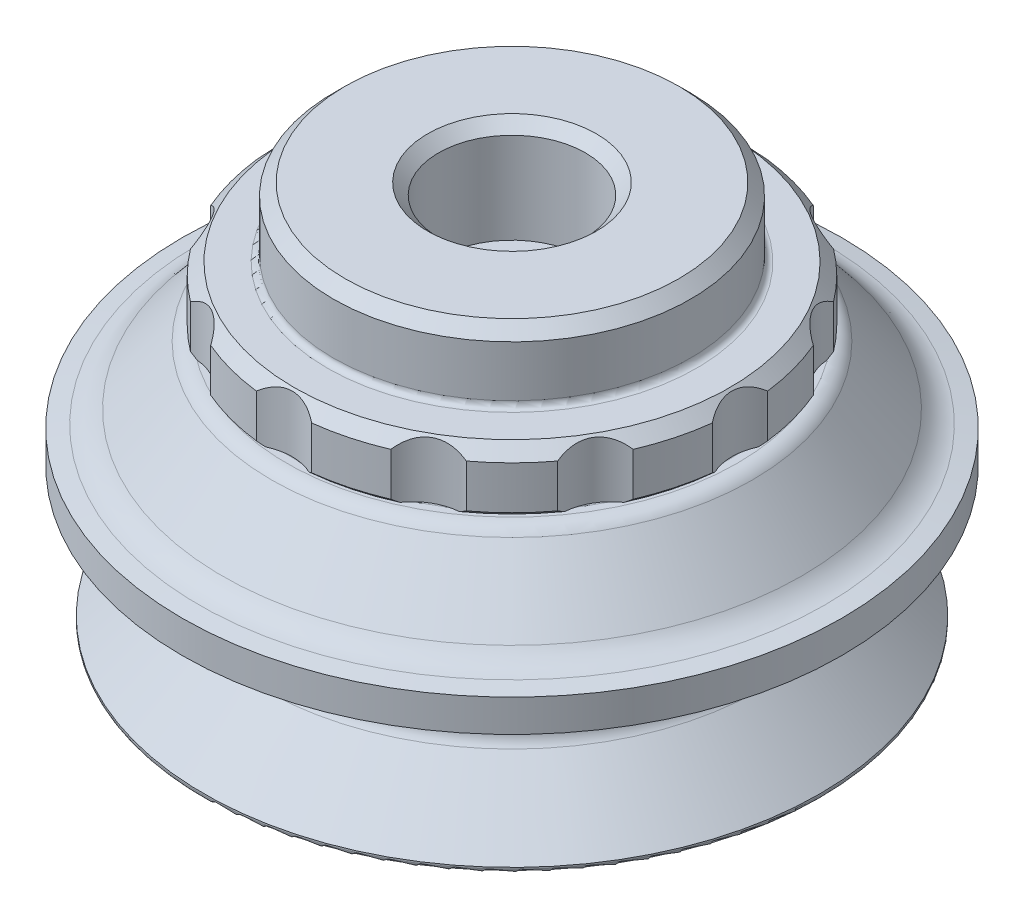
ISO-10303-21;
HEADER;
FILE_DESCRIPTION(('STEP AP214'),'2;1');
FILE_NAME('part.step','',(''),(''),'','','');
FILE_SCHEMA(('AUTOMOTIVE_DESIGN { 1 0 10303 214 1 1 1 1 }'));
ENDSEC;
DATA;
#1=APPLICATION_CONTEXT('core data for automotive mechanical design processes');
#2=APPLICATION_PROTOCOL_DEFINITION('international standard','automotive_design',2000,#1);
#3=PRODUCT_CONTEXT('',#1,'mechanical');
#4=PRODUCT('Part','Part','',(#3));
#5=PRODUCT_RELATED_PRODUCT_CATEGORY('part','',(#4));
#6=PRODUCT_DEFINITION_FORMATION('','',#4);
#7=PRODUCT_DEFINITION_CONTEXT('part definition',#1,'design');
#8=PRODUCT_DEFINITION('design','',#6,#7);
#9=PRODUCT_DEFINITION_SHAPE('','',#8);
#10=(LENGTH_UNIT() NAMED_UNIT(*) SI_UNIT(.MILLI.,.METRE.));
#11=(NAMED_UNIT(*) PLANE_ANGLE_UNIT() SI_UNIT($,.RADIAN.));
#12=(NAMED_UNIT(*) SI_UNIT($,.STERADIAN.) SOLID_ANGLE_UNIT());
#13=UNCERTAINTY_MEASURE_WITH_UNIT(LENGTH_MEASURE(1.E-05),#10,'distance_accuracy_value','');
#14=(GEOMETRIC_REPRESENTATION_CONTEXT(3) GLOBAL_UNCERTAINTY_ASSIGNED_CONTEXT((#13)) GLOBAL_UNIT_ASSIGNED_CONTEXT((#10,
#11,#12)) REPRESENTATION_CONTEXT('',''));
#15=CARTESIAN_POINT('',(0.,0.,0.));
#16=DIRECTION('',(0.,0.,1.));
#17=DIRECTION('',(1.,0.,0.));
#18=AXIS2_PLACEMENT_3D('',#15,#16,#17);
#19=CARTESIAN_POINT('',(-7.60594053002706,-4.318,25.5471485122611));
#20=DIRECTION('',(0.,1.,0.));
#21=DIRECTION('',(1.,0.,0.));
#22=AXIS2_PLACEMENT_3D('',#19,#20,#21);
#23=TOROIDAL_SURFACE('',#22,28.194,0.762);
#24=CARTESIAN_POINT('',(-7.60594053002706,-5.08,25.5471485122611));
#25=DIRECTION('',(0.,1.,0.));
#26=DIRECTION('',(1.,0.,0.));
#27=AXIS2_PLACEMENT_3D('',#24,#25,#26);
#28=CIRCLE('',#27,28.194);
#29=CARTESIAN_POINT('',(20.5880594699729,-5.08,25.5471485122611));
#30=VERTEX_POINT('',#29);
#31=EDGE_CURVE('E514',#30,#30,#28,.F.);
#32=ORIENTED_EDGE('',*,*,#31,.F.);
#33=EDGE_LOOP('',(#32));
#34=FACE_BOUND('',#33,.T.);
#35=CARTESIAN_POINT('',(-7.60594053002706,-4.699,25.5471485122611));
#36=DIRECTION('',(0.,-1.,0.));
#37=DIRECTION('',(0.,0.,-1.));
#38=AXIS2_PLACEMENT_3D('',#35,#36,#37);
#39=CIRCLE('',#38,27.5340886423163);
#40=CARTESIAN_POINT('',(-7.60594053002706,-4.699,-1.98694013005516));
#41=VERTEX_POINT('',#40);
#42=EDGE_CURVE('E10',#41,#41,#39,.F.);
#43=ORIENTED_EDGE('',*,*,#42,.F.);
#44=EDGE_LOOP('',(#43));
#45=FACE_BOUND('',#44,.T.);
#46=ADVANCED_FACE('F17',(#34,#45),#23,.F.);
#47=CARTESIAN_POINT('',(-7.60594053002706,-37.465,25.5471485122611));
#48=DIRECTION('',(0.,1.,0.));
#49=DIRECTION('',(1.,0.,0.));
#50=AXIS2_PLACEMENT_3D('',#47,#48,#49);
#51=CYLINDRICAL_SURFACE('',#50,42.672);
#52=CARTESIAN_POINT('',(-7.60594053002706,-15.6972,25.5471485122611));
#53=DIRECTION('',(0.,1.,0.));
#54=DIRECTION('',(1.,0.,0.));
#55=AXIS2_PLACEMENT_3D('',#52,#53,#54);
#56=CIRCLE('',#55,42.672);
#57=CARTESIAN_POINT('',(35.0660594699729,-15.6972,25.5471485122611));
#58=VERTEX_POINT('',#57);
#59=EDGE_CURVE('E500',#58,#58,#56,.T.);
#60=ORIENTED_EDGE('',*,*,#59,.F.);
#61=EDGE_LOOP('',(#60));
#62=FACE_BOUND('',#61,.T.);
#63=CARTESIAN_POINT('',(-7.60594053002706,-19.8815210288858,25.5471485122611));
#64=DIRECTION('',(0.,1.,0.));
#65=DIRECTION('',(1.,0.,0.));
#66=AXIS2_PLACEMENT_3D('',#63,#64,#65);
#67=CIRCLE('',#66,42.672);
#68=CARTESIAN_POINT('',(35.0660594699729,-19.8815210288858,25.5471485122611));
#69=VERTEX_POINT('',#68);
#70=EDGE_CURVE('E334',#69,#69,#67,.T.);
#71=ORIENTED_EDGE('',*,*,#70,.T.);
#72=EDGE_LOOP('',(#71));
#73=FACE_BOUND('',#72,.T.);
#74=ADVANCED_FACE('F569',(#62,#73),#51,.T.);
#75=CARTESIAN_POINT('',(-7.60594053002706,-7.62,25.5471485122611));
#76=DIRECTION('',(0.,1.,0.));
#77=DIRECTION('',(1.,0.,0.));
#78=AXIS2_PLACEMENT_3D('',#75,#76,#77);
#79=TOROIDAL_SURFACE('',#78,29.1592,2.54);
#80=CARTESIAN_POINT('',(-7.60594053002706,-5.08,25.5471485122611));
#81=DIRECTION('',(0.,1.,0.));
#82=DIRECTION('',(1.,0.,0.));
#83=AXIS2_PLACEMENT_3D('',#80,#81,#82);
#84=CIRCLE('',#83,29.1592);
#85=CARTESIAN_POINT('',(21.5532594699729,-5.08,25.5471485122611));
#86=VERTEX_POINT('',#85);
#87=EDGE_CURVE('E497',#86,#86,#84,.T.);
#88=ORIENTED_EDGE('',*,*,#87,.F.);
#89=EDGE_LOOP('',(#88));
#90=FACE_BOUND('',#89,.T.);
#91=CARTESIAN_POINT('',(-7.60594053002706,-5.98731947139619,25.5471485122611));
#92=DIRECTION('',(0.,1.,0.));
#93=DIRECTION('',(1.,0.,0.));
#94=AXIS2_PLACEMENT_3D('',#91,#92,#93);
#95=CIRCLE('',#94,31.1049528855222);
#96=CARTESIAN_POINT('',(23.4990123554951,-5.98731947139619,25.5471485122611));
#97=VERTEX_POINT('',#96);
#98=EDGE_CURVE('E511',#97,#97,#95,.T.);
#99=ORIENTED_EDGE('',*,*,#98,.T.);
#100=EDGE_LOOP('',(#99));
#101=FACE_BOUND('',#100,.T.);
#102=ADVANCED_FACE('F571',(#90,#101),#79,.T.);
#103=CARTESIAN_POINT('',(-7.60594053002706,-5.98731947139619,25.5471485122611));
#104=DIRECTION('',(0.,-1.,0.));
#105=DIRECTION('',(-1.,0.,0.));
#106=AXIS2_PLACEMENT_3D('',#103,#104,#105);
#107=CONICAL_SURFACE('',#106,31.1049528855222,0.698131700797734);
#108=CARTESIAN_POINT('',(-7.60594053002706,-13.5731585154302,25.5471485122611));
#109=DIRECTION('',(0.,1.,0.));
#110=DIRECTION('',(1.,0.,0.));
#111=AXIS2_PLACEMENT_3D('',#108,#109,#110);
#112=CIRCLE('',#111,37.4702276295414);
#113=CARTESIAN_POINT('',(29.8642870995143,-13.5731585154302,25.5471485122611));
#114=VERTEX_POINT('',#113);
#115=EDGE_CURVE('E507',#114,#114,#112,.T.);
#116=ORIENTED_EDGE('',*,*,#115,.T.);
#117=EDGE_LOOP('',(#116));
#118=FACE_BOUND('',#117,.T.);
#119=ORIENTED_EDGE('',*,*,#98,.F.);
#120=EDGE_LOOP('',(#119));
#121=FACE_BOUND('',#120,.T.);
#122=ADVANCED_FACE('F578',(#118,#121),#107,.T.);
#123=CARTESIAN_POINT('',(-7.60594053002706,-10.3077974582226,25.5471485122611));
#124=DIRECTION('',(0.,1.,0.));
#125=DIRECTION('',(1.,0.,0.));
#126=AXIS2_PLACEMENT_3D('',#123,#124,#125);
#127=TOROIDAL_SURFACE('',#126,41.3617334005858,5.08);
#128=ORIENTED_EDGE('',*,*,#115,.F.);
#129=EDGE_LOOP('',(#128));
#130=FACE_BOUND('',#129,.T.);
#131=CARTESIAN_POINT('',(-7.60594053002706,-15.3106208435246,25.5471485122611));
#132=DIRECTION('',(0.,1.,0.));
#133=DIRECTION('',(1.,0.,0.));
#134=AXIS2_PLACEMENT_3D('',#131,#132,#133);
#135=CIRCLE('',#134,40.4796006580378);
#136=CARTESIAN_POINT('',(32.8736601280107,-15.3106208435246,25.5471485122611));
#137=VERTEX_POINT('',#136);
#138=EDGE_CURVE('E504',#137,#137,#135,.T.);
#139=ORIENTED_EDGE('',*,*,#138,.T.);
#140=EDGE_LOOP('',(#139));
#141=FACE_BOUND('',#140,.T.);
#142=ADVANCED_FACE('F588',(#130,#141),#127,.F.);
#143=CARTESIAN_POINT('',(-7.60594053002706,-15.3106208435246,25.5471485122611));
#144=DIRECTION('',(0.,-1.,0.));
#145=DIRECTION('',(-1.,0.,0.));
#146=AXIS2_PLACEMENT_3D('',#143,#144,#145);
#147=CONICAL_SURFACE('',#146,40.4796006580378,1.39626340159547);
#148=ORIENTED_EDGE('',*,*,#59,.T.);
#149=EDGE_LOOP('',(#148));
#150=FACE_BOUND('',#149,.T.);
#151=ORIENTED_EDGE('',*,*,#138,.F.);
#152=EDGE_LOOP('',(#151));
#153=FACE_BOUND('',#152,.T.);
#154=ADVANCED_FACE('F592',(#150,#153),#147,.T.);
#155=CARTESIAN_POINT('',(-7.60594053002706,-5.08,0.649892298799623));
#156=DIRECTION('',(0.,1.,0.));
#157=DIRECTION('',(1.,0.,0.));
#158=AXIS2_PLACEMENT_3D('',#155,#156,#157);
#159=PLANE('',#158);
#160=ORIENTED_EDGE('',*,*,#31,.T.);
#161=EDGE_LOOP('',(#160));
#162=FACE_BOUND('',#161,.T.);
#163=ORIENTED_EDGE('',*,*,#87,.T.);
#164=EDGE_LOOP('',(#163));
#165=FACE_BOUND('',#164,.T.);
#166=ADVANCED_FACE('F536',(#162,#165),#159,.T.);
#167=CARTESIAN_POINT('',(-7.60594053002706,0.,25.5471485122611));
#168=DIRECTION('',(0.,1.,0.));
#169=DIRECTION('',(1.,0.,0.));
#170=AXIS2_PLACEMENT_3D('',#167,#168,#169);
#171=CYLINDRICAL_SURFACE('',#170,39.878);
#172=CARTESIAN_POINT('',(-7.60594053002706,-36.957,25.5471485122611));
#173=DIRECTION('',(0.,1.,0.));
#174=DIRECTION('',(1.,0.,0.));
#175=AXIS2_PLACEMENT_3D('',#172,#173,#174);
#176=CIRCLE('',#175,39.878);
#177=CARTESIAN_POINT('',(32.272059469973,-36.957,25.5471485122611));
#178=VERTEX_POINT('',#177);
#179=EDGE_CURVE('E518',#178,#178,#176,.T.);
#180=ORIENTED_EDGE('',*,*,#179,.T.);
#181=EDGE_LOOP('',(#180));
#182=FACE_BOUND('',#181,.T.);
#183=CARTESIAN_POINT('',(-7.60594053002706,-36.7538,25.5471485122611));
#184=DIRECTION('',(0.,1.,0.));
#185=DIRECTION('',(1.,0.,0.));
#186=AXIS2_PLACEMENT_3D('',#183,#184,#185);
#187=CIRCLE('',#186,39.878);
#188=CARTESIAN_POINT('',(32.272059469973,-36.7538,25.5471485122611));
#189=VERTEX_POINT('',#188);
#190=EDGE_CURVE('E494',#189,#189,#187,.T.);
#191=ORIENTED_EDGE('',*,*,#190,.F.);
#192=EDGE_LOOP('',(#191));
#193=FACE_BOUND('',#192,.T.);
#194=ADVANCED_FACE('F532',(#182,#193),#171,.T.);
#195=CARTESIAN_POINT('',(-7.60594053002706,-28.986766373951,25.5471485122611));
#196=DIRECTION('',(0.,-1.,0.));
#197=DIRECTION('',(-1.,0.,0.));
#198=AXIS2_PLACEMENT_3D('',#195,#196,#197);
#199=CONICAL_SURFACE('',#198,32.110966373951,0.78539816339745);
#200=ORIENTED_EDGE('',*,*,#190,.T.);
#201=EDGE_LOOP('',(#200));
#202=FACE_BOUND('',#201,.T.);
#203=CARTESIAN_POINT('',(-7.60594053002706,-28.986766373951,25.5471485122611));
#204=DIRECTION('',(0.,1.,0.));
#205=DIRECTION('',(1.,0.,0.));
#206=AXIS2_PLACEMENT_3D('',#203,#204,#205);
#207=CIRCLE('',#206,32.110966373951);
#208=CARTESIAN_POINT('',(24.5050258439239,-28.986766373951,25.5471485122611));
#209=VERTEX_POINT('',#208);
#210=EDGE_CURVE('E490',#209,#209,#207,.T.);
#211=ORIENTED_EDGE('',*,*,#210,.F.);
#212=EDGE_LOOP('',(#211));
#213=FACE_BOUND('',#212,.T.);
#214=ADVANCED_FACE('F535',(#202,#213),#199,.T.);
#215=CARTESIAN_POINT('',(-7.60594053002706,-27.3703202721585,25.5471485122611));
#216=DIRECTION('',(0.,1.,0.));
#217=DIRECTION('',(1.,0.,0.));
#218=AXIS2_PLACEMENT_3D('',#215,#216,#217);
#219=TOROIDAL_SURFACE('',#218,33.7274124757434,2.286);
#220=ORIENTED_EDGE('',*,*,#210,.T.);
#221=EDGE_LOOP('',(#220));
#222=FACE_BOUND('',#221,.T.);
#223=CARTESIAN_POINT('',(-7.60594053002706,-25.6191426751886,25.5471485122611));
#224=DIRECTION('',(0.,1.,0.));
#225=DIRECTION('',(1.,0.,0.));
#226=AXIS2_PLACEMENT_3D('',#223,#224,#225);
#227=CIRCLE('',#226,32.258);
#228=CARTESIAN_POINT('',(24.6520594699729,-25.6191426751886,25.5471485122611));
#229=VERTEX_POINT('',#228);
#230=EDGE_CURVE('E487',#229,#229,#227,.T.);
#231=ORIENTED_EDGE('',*,*,#230,.F.);
#232=EDGE_LOOP('',(#231));
#233=FACE_BOUND('',#232,.T.);
#234=ADVANCED_FACE('F542',(#222,#233),#219,.F.);
#235=CARTESIAN_POINT('',(-7.60594053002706,-21.0700152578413,25.5471485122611));
#236=DIRECTION('',(0.,1.,0.));
#237=DIRECTION('',(1.,0.,0.));
#238=AXIS2_PLACEMENT_3D('',#235,#236,#237);
#239=CONICAL_SURFACE('',#238,37.6794389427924,0.872664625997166);
#240=ORIENTED_EDGE('',*,*,#230,.T.);
#241=EDGE_LOOP('',(#240));
#242=FACE_BOUND('',#241,.T.);
#243=CARTESIAN_POINT('',(-7.60594053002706,-21.0700152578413,25.5471485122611));
#244=DIRECTION('',(0.,1.,0.));
#245=DIRECTION('',(1.,0.,0.));
#246=AXIS2_PLACEMENT_3D('',#243,#244,#245);
#247=CIRCLE('',#246,37.6794389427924);
#248=CARTESIAN_POINT('',(30.0734984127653,-21.0700152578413,25.5471485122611));
#249=VERTEX_POINT('',#248);
#250=EDGE_CURVE('E483',#249,#249,#247,.T.);
#251=ORIENTED_EDGE('',*,*,#250,.F.);
#252=EDGE_LOOP('',(#251));
#253=FACE_BOUND('',#252,.T.);
#254=ADVANCED_FACE('F548',(#242,#253),#239,.T.);
#255=CARTESIAN_POINT('',(-7.60594053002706,-24.9615210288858,25.5471485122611));
#256=DIRECTION('',(0.,1.,0.));
#257=DIRECTION('',(1.,0.,0.));
#258=AXIS2_PLACEMENT_3D('',#255,#256,#257);
#259=TOROIDAL_SURFACE('',#258,40.9448,5.08);
#260=ORIENTED_EDGE('',*,*,#250,.T.);
#261=EDGE_LOOP('',(#260));
#262=FACE_BOUND('',#261,.T.);
#263=CARTESIAN_POINT('',(-7.60594053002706,-19.8815210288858,25.5471485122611));
#264=DIRECTION('',(0.,1.,0.));
#265=DIRECTION('',(1.,0.,0.));
#266=AXIS2_PLACEMENT_3D('',#263,#264,#265);
#267=CIRCLE('',#266,40.9448);
#268=CARTESIAN_POINT('',(33.3388594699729,-19.8815210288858,25.5471485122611));
#269=VERTEX_POINT('',#268);
#270=EDGE_CURVE('E479',#269,#269,#267,.T.);
#271=ORIENTED_EDGE('',*,*,#270,.F.);
#272=EDGE_LOOP('',(#271));
#273=FACE_BOUND('',#272,.T.);
#274=ADVANCED_FACE('F554',(#262,#273),#259,.F.);
#275=CARTESIAN_POINT('',(-7.60594053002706,-19.8815210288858,-17.1248514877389));
#276=DIRECTION('',(0.,-1.,0.));
#277=DIRECTION('',(-1.,0.,0.));
#278=AXIS2_PLACEMENT_3D('',#275,#276,#277);
#279=PLANE('',#278);
#280=ORIENTED_EDGE('',*,*,#270,.T.);
#281=EDGE_LOOP('',(#280));
#282=FACE_BOUND('',#281,.T.);
#283=ORIENTED_EDGE('',*,*,#70,.F.);
#284=EDGE_LOOP('',(#283));
#285=FACE_BOUND('',#284,.T.);
#286=ADVANCED_FACE('F560',(#282,#285),#279,.T.);
#287=CARTESIAN_POINT('',(-7.60594053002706,-37.465,25.5471485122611));
#288=DIRECTION('',(0.,1.,0.));
#289=DIRECTION('',(1.,0.,0.));
#290=AXIS2_PLACEMENT_3D('',#287,#288,#289);
#291=PLANE('',#290);
#292=CARTESIAN_POINT('',(-7.60594053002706,-37.465,25.5471485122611));
#293=DIRECTION('',(0.,1.,0.));
#294=DIRECTION('',(1.,0.,0.));
#295=AXIS2_PLACEMENT_3D('',#292,#293,#294);
#296=CIRCLE('',#295,39.37);
#297=CARTESIAN_POINT('',(31.7640594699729,-37.465,25.5471485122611));
#298=VERTEX_POINT('',#297);
#299=EDGE_CURVE('E26',#298,#298,#296,.F.);
#300=ORIENTED_EDGE('',*,*,#299,.T.);
#301=EDGE_LOOP('',(#300));
#302=FACE_BOUND('',#301,.T.);
#303=ADVANCED_FACE('F526',(#302),#291,.F.);
#304=CARTESIAN_POINT('',(-7.60594053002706,-36.957,25.5471485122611));
#305=DIRECTION('',(0.,1.,0.));
#306=DIRECTION('',(1.,0.,0.));
#307=AXIS2_PLACEMENT_3D('',#304,#305,#306);
#308=TOROIDAL_SURFACE('',#307,39.37,0.508);
#309=ORIENTED_EDGE('',*,*,#299,.F.);
#310=EDGE_LOOP('',(#309));
#311=FACE_BOUND('',#310,.T.);
#312=ORIENTED_EDGE('',*,*,#179,.F.);
#313=EDGE_LOOP('',(#312));
#314=FACE_BOUND('',#313,.T.);
#315=ADVANCED_FACE('F19',(#311,#314),#308,.T.);
#316=CARTESIAN_POINT('',(21.6040594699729,-4.699,25.5471485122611));
#317=DIRECTION('',(0.,1.,0.));
#318=DIRECTION('',(0.,0.,1.));
#319=AXIS2_PLACEMENT_3D('',#316,#317,#318);
#320=PLANE('',#319);
#321=CARTESIAN_POINT('',(-7.60594053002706,-4.699,25.5471485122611));
#322=DIRECTION('',(0.,1.,0.));
#323=DIRECTION('',(0.,0.,1.));
#324=AXIS2_PLACEMENT_3D('',#321,#322,#323);
#325=CIRCLE('',#324,29.21);
#326=CARTESIAN_POINT('',(18.9775073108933,-4.699,37.6527009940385));
#327=VERTEX_POINT('',#326);
#328=CARTESIAN_POINT('',(21.4687768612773,-4.699,28.355156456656));
#329=VERTEX_POINT('',#328);
#330=EDGE_CURVE('E341',#327,#329,#325,.T.);
#331=ORIENTED_EDGE('',*,*,#330,.F.);
#332=CARTESIAN_POINT('',(22.7499819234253,-4.699,43.0731485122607));
#333=DIRECTION('',(0.,1.,0.));
#334=DIRECTION('',(0.,0.,1.));
#335=AXIS2_PLACEMENT_3D('',#332,#333,#334);
#336=CIRCLE('',#335,6.604);
#337=CARTESIAN_POINT('',(16.1694993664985,-4.699,42.5163134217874));
#338=VERTEX_POINT('',#337);
#339=EDGE_CURVE('E324',#327,#338,#336,.T.);
#340=ORIENTED_EDGE('',*,*,#339,.T.);
#341=CARTESIAN_POINT('',(9.36322437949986,-4.699,49.3225884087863));
#342=VERTEX_POINT('',#341);
#343=EDGE_CURVE('E353',#342,#338,#325,.T.);
#344=ORIENTED_EDGE('',*,*,#343,.F.);
#345=CARTESIAN_POINT('',(9.9200594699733,-4.699,55.903070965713));
#346=DIRECTION('',(0.,1.,0.));
#347=DIRECTION('',(0.,0.,1.));
#348=AXIS2_PLACEMENT_3D('',#345,#346,#347);
#349=CIRCLE('',#348,6.604);
#350=CARTESIAN_POINT('',(4.49961195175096,-4.699,52.1305963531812));
#351=VERTEX_POINT('',#350);
#352=EDGE_CURVE('E335',#342,#351,#349,.T.);
#353=ORIENTED_EDGE('',*,*,#352,.T.);
#354=CARTESIAN_POINT('',(-4.7979325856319,-4.699,54.6218659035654));
#355=VERTEX_POINT('',#354);
#356=EDGE_CURVE('E362',#355,#351,#325,.T.);
#357=ORIENTED_EDGE('',*,*,#356,.F.);
#358=CARTESIAN_POINT('',(-7.60594053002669,-4.699,60.5991485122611));
#359=DIRECTION('',(0.,1.,0.));
#360=DIRECTION('',(0.,0.,1.));
#361=AXIS2_PLACEMENT_3D('',#358,#359,#360);
#362=CIRCLE('',#361,6.604);
#363=CARTESIAN_POINT('',(-10.4139484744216,-4.699,54.6218659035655));
#364=VERTEX_POINT('',#363);
#365=EDGE_CURVE('E467',#355,#364,#362,.T.);
#366=ORIENTED_EDGE('',*,*,#365,.T.);
#367=CARTESIAN_POINT('',(-19.7114930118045,-4.699,52.1305963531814));
#368=VERTEX_POINT('',#367);
#369=EDGE_CURVE('E438',#368,#364,#325,.T.);
#370=ORIENTED_EDGE('',*,*,#369,.F.);
#371=CARTESIAN_POINT('',(-25.1319405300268,-4.699,55.9030709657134));
#372=DIRECTION('',(0.,1.,0.));
#373=DIRECTION('',(0.,0.,1.));
#374=AXIS2_PLACEMENT_3D('',#371,#372,#373);
#375=CIRCLE('',#374,6.604);
#376=CARTESIAN_POINT('',(-24.5751054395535,-4.699,49.3225884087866));
#377=VERTEX_POINT('',#376);
#378=EDGE_CURVE('E473',#368,#377,#375,.T.);
#379=ORIENTED_EDGE('',*,*,#378,.T.);
#380=CARTESIAN_POINT('',(-31.3813804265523,-4.699,42.5163134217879));
#381=VERTEX_POINT('',#380);
#382=EDGE_CURVE('E428',#381,#377,#325,.T.);
#383=ORIENTED_EDGE('',*,*,#382,.F.);
#384=CARTESIAN_POINT('',(-37.9618629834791,-4.699,43.0731485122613));
#385=DIRECTION('',(0.,1.,0.));
#386=DIRECTION('',(0.,0.,1.));
#387=AXIS2_PLACEMENT_3D('',#384,#385,#386);
#388=CIRCLE('',#387,6.604);
#389=CARTESIAN_POINT('',(-34.1893883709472,-4.699,37.652700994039));
#390=VERTEX_POINT('',#389);
#391=EDGE_CURVE('E990',#381,#390,#388,.T.);
#392=ORIENTED_EDGE('',*,*,#391,.T.);
#393=CARTESIAN_POINT('',(-36.6806579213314,-4.699,28.3551564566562));
#394=VERTEX_POINT('',#393);
#395=EDGE_CURVE('E418',#394,#390,#325,.T.);
#396=ORIENTED_EDGE('',*,*,#395,.F.);
#397=CARTESIAN_POINT('',(-42.6579405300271,-4.699,25.5471485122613));
#398=DIRECTION('',(0.,1.,0.));
#399=DIRECTION('',(0.,0.,1.));
#400=AXIS2_PLACEMENT_3D('',#397,#398,#399);
#401=CIRCLE('',#400,6.604);
#402=CARTESIAN_POINT('',(-36.6806579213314,-4.699,22.7391405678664));
#403=VERTEX_POINT('',#402);
#404=EDGE_CURVE('E987',#394,#403,#401,.T.);
#405=ORIENTED_EDGE('',*,*,#404,.T.);
#406=CARTESIAN_POINT('',(-34.1893883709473,-4.699,13.4415960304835));
#407=VERTEX_POINT('',#406);
#408=EDGE_CURVE('E409',#407,#403,#325,.T.);
#409=ORIENTED_EDGE('',*,*,#408,.F.);
#410=CARTESIAN_POINT('',(-37.9618629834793,-4.699,8.02114851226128));
#411=DIRECTION('',(0.,1.,0.));
#412=DIRECTION('',(0.,0.,1.));
#413=AXIS2_PLACEMENT_3D('',#410,#411,#412);
#414=CIRCLE('',#413,6.604);
#415=CARTESIAN_POINT('',(-31.3813804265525,-4.699,8.57798360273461));
#416=VERTEX_POINT('',#415);
#417=EDGE_CURVE('E983',#407,#416,#414,.T.);
#418=ORIENTED_EDGE('',*,*,#417,.T.);
#419=CARTESIAN_POINT('',(-24.5751054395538,-4.699,1.77170861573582));
#420=VERTEX_POINT('',#419);
#421=EDGE_CURVE('E401',#420,#416,#325,.T.);
#422=ORIENTED_EDGE('',*,*,#421,.F.);
#423=CARTESIAN_POINT('',(-25.1319405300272,-4.699,-4.80877394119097));
#424=DIRECTION('',(0.,1.,0.));
#425=DIRECTION('',(0.,0.,1.));
#426=AXIS2_PLACEMENT_3D('',#423,#424,#425);
#427=CIRCLE('',#426,6.604);
#428=CARTESIAN_POINT('',(-19.7114930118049,-4.699,-1.03629932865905));
#429=VERTEX_POINT('',#428);
#430=EDGE_CURVE('E979',#420,#429,#427,.T.);
#431=ORIENTED_EDGE('',*,*,#430,.T.);
#432=CARTESIAN_POINT('',(-10.413948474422,-4.699,-3.52756887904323));
#433=VERTEX_POINT('',#432);
#434=EDGE_CURVE('E392',#433,#429,#325,.T.);
#435=ORIENTED_EDGE('',*,*,#434,.F.);
#436=CARTESIAN_POINT('',(-7.60594053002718,-4.699,-9.5048514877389));
#437=DIRECTION('',(0.,1.,0.));
#438=DIRECTION('',(0.,0.,1.));
#439=AXIS2_PLACEMENT_3D('',#436,#437,#438);
#440=CIRCLE('',#439,6.604);
#441=CARTESIAN_POINT('',(-4.79793258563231,-4.699,-3.52756887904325));
#442=VERTEX_POINT('',#441);
#443=EDGE_CURVE('E975',#433,#442,#440,.T.);
#444=ORIENTED_EDGE('',*,*,#443,.T.);
#445=CARTESIAN_POINT('',(4.49961195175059,-4.699,-1.03629932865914));
#446=VERTEX_POINT('',#445);
#447=EDGE_CURVE('E382',#446,#442,#325,.T.);
#448=ORIENTED_EDGE('',*,*,#447,.F.);
#449=CARTESIAN_POINT('',(9.92005946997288,-4.699,-4.80877394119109));
#450=DIRECTION('',(0.,1.,0.));
#451=DIRECTION('',(0.,0.,1.));
#452=AXIS2_PLACEMENT_3D('',#449,#450,#451);
#453=CIRCLE('',#452,6.604);
#454=CARTESIAN_POINT('',(9.36322437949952,-4.699,1.77170861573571));
#455=VERTEX_POINT('',#454);
#456=EDGE_CURVE('E972',#446,#455,#453,.T.);
#457=ORIENTED_EDGE('',*,*,#456,.T.);
#458=CARTESIAN_POINT('',(16.1694993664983,-4.699,8.57798360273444));
#459=VERTEX_POINT('',#458);
#460=EDGE_CURVE('E370',#459,#455,#325,.T.);
#461=ORIENTED_EDGE('',*,*,#460,.F.);
#462=CARTESIAN_POINT('',(22.7499819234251,-4.699,8.02114851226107));
#463=DIRECTION('',(0.,1.,0.));
#464=DIRECTION('',(0.,0.,1.));
#465=AXIS2_PLACEMENT_3D('',#462,#463,#464);
#466=CIRCLE('',#465,6.604);
#467=CARTESIAN_POINT('',(18.9775073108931,-4.699,13.4415960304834));
#468=VERTEX_POINT('',#467);
#469=EDGE_CURVE('E968',#459,#468,#466,.T.);
#470=ORIENTED_EDGE('',*,*,#469,.T.);
#471=CARTESIAN_POINT('',(21.4687768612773,-4.699,22.7391405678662));
#472=VERTEX_POINT('',#471);
#473=EDGE_CURVE('E356',#472,#468,#325,.T.);
#474=ORIENTED_EDGE('',*,*,#473,.F.);
#475=CARTESIAN_POINT('',(27.4460594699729,-4.699,25.5471485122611));
#476=DIRECTION('',(0.,1.,0.));
#477=DIRECTION('',(0.,0.,1.));
#478=AXIS2_PLACEMENT_3D('',#475,#476,#477);
#479=CIRCLE('',#478,6.604);
#480=EDGE_CURVE('E351',#472,#329,#479,.T.);
#481=ORIENTED_EDGE('',*,*,#480,.T.);
#482=EDGE_LOOP('',(#331,#340,#344,#353,#357,#366,#370,#379,#383,#392,#396,#405,#409,#418,#422,
#431,#435,#444,#448,#457,#461,#470,#474,#481));
#483=FACE_BOUND('',#482,.T.);
#484=ORIENTED_EDGE('',*,*,#42,.T.);
#485=EDGE_LOOP('',(#484));
#486=FACE_BOUND('',#485,.T.);
#487=ADVANCED_FACE('F348',(#483,#486),#320,.F.);
#488=CARTESIAN_POINT('',(-7.60594053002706,11.811,25.5471485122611));
#489=DIRECTION('',(0.,1.,0.));
#490=DIRECTION('',(0.,0.,1.));
#491=AXIS2_PLACEMENT_3D('',#488,#489,#490);
#492=CYLINDRICAL_SURFACE('',#491,29.718);
#493=CARTESIAN_POINT('',(-7.60594053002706,1.397,25.5471485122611));
#494=DIRECTION('',(0.,1.,0.));
#495=DIRECTION('',(0.,0.,1.));
#496=AXIS2_PLACEMENT_3D('',#493,#494,#495);
#497=CIRCLE('',#496,29.718);
#498=CARTESIAN_POINT('',(19.7326759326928,1.397,37.1987395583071));
#499=VERTEX_POINT('',#498);
#500=CARTESIAN_POINT('',(21.8957913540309,1.397,29.1258829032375));
#501=VERTEX_POINT('',#500);
#502=EDGE_CURVE('E940',#499,#501,#497,.T.);
#503=ORIENTED_EDGE('',*,*,#502,.F.);
#504=DIRECTION('',(0.,1.,0.));
#505=VECTOR('',#504,1.);
#506=CARTESIAN_POINT('',(19.7326759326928,0.381000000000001,37.1987395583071));
#507=LINE('',#506,#505);
#508=CARTESIAN_POINT('',(19.7326759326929,-4.191,37.1987395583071));
#509=VERTEX_POINT('',#508);
#510=EDGE_CURVE('E891',#499,#509,#507,.F.);
#511=ORIENTED_EDGE('',*,*,#510,.T.);
#512=CARTESIAN_POINT('',(-7.60594053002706,-4.191,25.5471485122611));
#513=DIRECTION('',(0.,1.,0.));
#514=DIRECTION('',(0.,0.,1.));
#515=AXIS2_PLACEMENT_3D('',#512,#513,#514);
#516=CIRCLE('',#515,29.718);
#517=CARTESIAN_POINT('',(21.8957913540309,-4.191,29.1258829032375));
#518=VERTEX_POINT('',#517);
#519=EDGE_CURVE('E343',#509,#518,#516,.T.);
#520=ORIENTED_EDGE('',*,*,#519,.T.);
#521=DIRECTION('',(0.,1.,0.));
#522=VECTOR('',#521,1.);
#523=CARTESIAN_POINT('',(21.8957913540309,0.381000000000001,29.1258829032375));
#524=LINE('',#523,#522);
#525=EDGE_CURVE('E1115',#518,#501,#524,.T.);
#526=ORIENTED_EDGE('',*,*,#525,.T.);
#527=EDGE_LOOP('',(#503,#511,#520,#526));
#528=FACE_BOUND('',#527,.T.);
#529=ADVANCED_FACE('F1306',(#528),#492,.T.);
#530=CARTESIAN_POINT('',(-7.60594053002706,-4.699,25.5471485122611));
#531=DIRECTION('',(0.,1.,0.));
#532=DIRECTION('',(0.,0.,1.));
#533=AXIS2_PLACEMENT_3D('',#530,#531,#532);
#534=CONICAL_SURFACE('',#533,29.21,0.785398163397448);
#535=ORIENTED_EDGE('',*,*,#343,.T.);
#536=CARTESIAN_POINT('',(16.1695324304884,-4.69919999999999,42.5159228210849));
#537=CARTESIAN_POINT('',(16.1631465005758,-4.66058479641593,42.5913413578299));
#538=CARTESIAN_POINT('',(16.1581023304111,-4.62091323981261,42.6663249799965));
#539=CARTESIAN_POINT('',(16.1505986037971,-4.53968277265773,42.8152564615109));
#540=CARTESIAN_POINT('',(16.1481353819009,-4.49812662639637,42.8892056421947));
#541=CARTESIAN_POINT('',(16.1456771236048,-4.41324303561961,43.0361145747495));
#542=CARTESIAN_POINT('',(16.145682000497,-4.36991565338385,43.1090743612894));
#543=CARTESIAN_POINT('',(16.1480620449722,-4.28157371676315,43.2540695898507));
#544=CARTESIAN_POINT('',(16.1504405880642,-4.2365568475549,43.326103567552));
#545=CARTESIAN_POINT('',(16.1539569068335,-4.19079999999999,43.3976018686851));
#546=B_SPLINE_CURVE_WITH_KNOTS('',3,(#536,#537,#538,#539,#540,#541,#542,#543,#544,#545),
.UNSPECIFIED.,.F.,.F.,(4,2,2,2,4),(0.,0.254881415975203,0.509400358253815,0.763910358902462,
1.01878280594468),.UNSPECIFIED.);
#547=CARTESIAN_POINT('',(16.1539415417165,-4.191,43.3972893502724));
#548=VERTEX_POINT('',#547);
#549=EDGE_CURVE('E38',#338,#548,#546,.T.);
#550=ORIENTED_EDGE('',*,*,#549,.T.);
#551=CARTESIAN_POINT('',(10.2442003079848,-4.191,49.3070305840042));
#552=VERTEX_POINT('',#551);
#553=EDGE_CURVE('E378',#552,#548,#516,.T.);
#554=ORIENTED_EDGE('',*,*,#553,.F.);
#555=CARTESIAN_POINT('',(10.2445128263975,-4.1908,49.3070459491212));
#556=CARTESIAN_POINT('',(10.1730145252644,-4.23655684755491,49.3035296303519));
#557=CARTESIAN_POINT('',(10.1009805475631,-4.28157371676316,49.3011510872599));
#558=CARTESIAN_POINT('',(9.95598531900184,-4.36991565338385,49.2987710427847));
#559=CARTESIAN_POINT('',(9.88302553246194,-4.41324303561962,49.2987661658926));
#560=CARTESIAN_POINT('',(9.73611659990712,-4.49812662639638,49.3012244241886));
#561=CARTESIAN_POINT('',(9.66216741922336,-4.53968277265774,49.3036876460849));
#562=CARTESIAN_POINT('',(9.51323593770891,-4.62091323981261,49.3111913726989));
#563=CARTESIAN_POINT('',(9.43825231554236,-4.66058479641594,49.3162355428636));
#564=CARTESIAN_POINT('',(9.36283377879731,-4.6992,49.3226214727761));
#565=B_SPLINE_CURVE_WITH_KNOTS('',3,(#555,#556,#557,#558,#559,#560,#561,#562,#563,#564),
.UNSPECIFIED.,.F.,.F.,(4,2,2,2,4),(0.,0.254872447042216,0.509382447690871,0.763901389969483,
1.01878280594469),.UNSPECIFIED.);
#566=EDGE_CURVE('E744',#552,#342,#565,.T.);
#567=ORIENTED_EDGE('',*,*,#566,.T.);
#568=EDGE_LOOP('',(#535,#550,#554,#567));
#569=FACE_BOUND('',#568,.T.);
#570=ADVANCED_FACE('F758',(#569),#534,.T.);
#571=ORIENTED_EDGE('',*,*,#553,.T.);
#572=DIRECTION('',(0.,1.,0.));
#573=VECTOR('',#572,1.);
#574=CARTESIAN_POINT('',(16.1539415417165,0.381000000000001,43.3972893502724));
#575=LINE('',#574,#573);
#576=CARTESIAN_POINT('',(16.1539415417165,1.397,43.3972893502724));
#577=VERTEX_POINT('',#576);
#578=EDGE_CURVE('E888',#548,#577,#575,.T.);
#579=ORIENTED_EDGE('',*,*,#578,.T.);
#580=CARTESIAN_POINT('',(10.2442003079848,1.397,49.3070305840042));
#581=VERTEX_POINT('',#580);
#582=EDGE_CURVE('E915',#581,#577,#497,.T.);
#583=ORIENTED_EDGE('',*,*,#582,.F.);
#584=DIRECTION('',(0.,1.,0.));
#585=VECTOR('',#584,1.);
#586=CARTESIAN_POINT('',(10.2442003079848,0.381000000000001,49.3070305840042));
#587=LINE('',#586,#585);
#588=EDGE_CURVE('E727',#581,#552,#587,.F.);
#589=ORIENTED_EDGE('',*,*,#588,.T.);
#590=EDGE_LOOP('',(#571,#579,#583,#589));
#591=FACE_BOUND('',#590,.T.);
#592=ADVANCED_FACE('F914',(#591),#492,.T.);
#593=ORIENTED_EDGE('',*,*,#356,.T.);
#594=CARTESIAN_POINT('',(4.49983588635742,-4.6992,52.130274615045));
#595=CARTESIAN_POINT('',(4.45659624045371,-4.66058479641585,52.1923960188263));
#596=CARTESIAN_POINT('',(4.41473604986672,-4.62091323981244,52.2548116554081));
#597=CARTESIAN_POINT('',(4.33377189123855,-4.53968277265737,52.3800382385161));
#598=CARTESIAN_POINT('',(4.2946640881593,-4.49812662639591,52.4428484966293));
#599=CARTESIAN_POINT('',(4.21908070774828,-4.41324303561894,52.5688462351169));
#600=CARTESIAN_POINT('',(4.18260503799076,-4.36991565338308,52.6320337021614));
#601=CARTESIAN_POINT('',(4.11216860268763,-4.28157371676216,52.7587932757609));
#602=CARTESIAN_POINT('',(4.07821149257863,-4.2365568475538,52.8223658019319));
#603=CARTESIAN_POINT('',(4.04550756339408,-4.19079999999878,52.8860433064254));
#604=B_SPLINE_CURVE_WITH_KNOTS('',3,(#594,#595,#596,#597,#598,#599,#600,#601,#602,#603),
.UNSPECIFIED.,.F.,.F.,(4,2,2,2,4),(0.,0.254881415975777,0.509400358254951,0.763910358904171,
1.01878280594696),.UNSPECIFIED.);
#605=CARTESIAN_POINT('',(4.04565051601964,-4.191,52.8857649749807));
#606=VERTEX_POINT('',#605);
#607=EDGE_CURVE('E50',#351,#606,#604,.T.);
#608=ORIENTED_EDGE('',*,*,#607,.T.);
#609=CARTESIAN_POINT('',(-4.02720613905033,-4.191,55.048880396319));
#610=VERTEX_POINT('',#609);
#611=EDGE_CURVE('E929',#610,#606,#516,.T.);
#612=ORIENTED_EDGE('',*,*,#611,.F.);
#613=CARTESIAN_POINT('',(-4.02694317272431,-4.1908,55.049049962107));
#614=CARTESIAN_POINT('',(-4.08710435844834,-4.23655684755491,55.0102555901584));
#615=CARTESIAN_POINT('',(-4.14829834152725,-4.28157371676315,54.9721787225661));
#616=CARTESIAN_POINT('',(-4.27267787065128,-4.36991565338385,54.8976199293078));
#617=CARTESIAN_POINT('',(-4.33586046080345,-4.41324303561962,54.8611358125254));
#618=CARTESIAN_POINT('',(-4.46431645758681,-4.49812662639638,54.7898102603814));
#619=CARTESIAN_POINT('',(-4.52958993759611,-4.53968277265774,54.7549688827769));
#620=CARTESIAN_POINT('',(-4.66232024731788,-4.62091323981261,54.6870015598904));
#621=CARTESIAN_POINT('',(-4.72978005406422,-4.66058479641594,54.6538781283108));
#622=CARTESIAN_POINT('',(-4.79828738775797,-4.6992,54.6216992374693));
#623=B_SPLINE_CURVE_WITH_KNOTS('',3,(#613,#614,#615,#616,#617,#618,#619,#620,#621,#622),
.UNSPECIFIED.,.F.,.F.,(4,2,2,2,4),(0.,0.254872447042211,0.509382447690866,0.763901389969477,
1.01878280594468),.UNSPECIFIED.);
#624=EDGE_CURVE('E465',#610,#355,#623,.T.);
#625=ORIENTED_EDGE('',*,*,#624,.T.);
#626=EDGE_LOOP('',(#593,#608,#612,#625));
#627=FACE_BOUND('',#626,.T.);
#628=ADVANCED_FACE('F462',(#627),#534,.T.);
#629=ORIENTED_EDGE('',*,*,#611,.T.);
#630=DIRECTION('',(0.,1.,0.));
#631=VECTOR('',#630,1.);
#632=CARTESIAN_POINT('',(4.04565051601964,0.381000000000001,52.8857649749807));
#633=LINE('',#632,#631);
#634=CARTESIAN_POINT('',(4.04565051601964,1.397,52.8857649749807));
#635=VERTEX_POINT('',#634);
#636=EDGE_CURVE('E753',#606,#635,#633,.T.);
#637=ORIENTED_EDGE('',*,*,#636,.T.);
#638=CARTESIAN_POINT('',(-4.02720613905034,1.397,55.048880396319));
#639=VERTEX_POINT('',#638);
#640=EDGE_CURVE('E928',#639,#635,#497,.T.);
#641=ORIENTED_EDGE('',*,*,#640,.F.);
#642=DIRECTION('',(0.,1.,0.));
#643=VECTOR('',#642,1.);
#644=CARTESIAN_POINT('',(-4.02720613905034,0.381000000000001,55.048880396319));
#645=LINE('',#644,#643);
#646=EDGE_CURVE('E1008',#639,#610,#645,.F.);
#647=ORIENTED_EDGE('',*,*,#646,.T.);
#648=EDGE_LOOP('',(#629,#637,#641,#647));
#649=FACE_BOUND('',#648,.T.);
#650=ADVANCED_FACE('F926',(#649),#492,.T.);
#651=ORIENTED_EDGE('',*,*,#369,.T.);
#652=CARTESIAN_POINT('',(-10.4135936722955,-4.6992,54.6216992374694));
#653=CARTESIAN_POINT('',(-10.4821010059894,-4.66058479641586,54.6538781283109));
#654=CARTESIAN_POINT('',(-10.5495608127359,-4.62091323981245,54.6870015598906));
#655=CARTESIAN_POINT('',(-10.6822911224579,-4.53968277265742,54.7549688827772));
#656=CARTESIAN_POINT('',(-10.7475646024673,-4.49812662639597,54.7898102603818));
#657=CARTESIAN_POINT('',(-10.8760205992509,-4.41324303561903,54.8611358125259));
#658=CARTESIAN_POINT('',(-10.9392031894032,-4.36991565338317,54.8976199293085));
#659=CARTESIAN_POINT('',(-11.0635827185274,-4.28157371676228,54.9721787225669));
#660=CARTESIAN_POINT('',(-11.1247767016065,-4.23655684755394,55.0102555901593));
#661=CARTESIAN_POINT('',(-11.1849378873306,-4.19079999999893,55.049049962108));
#662=B_SPLINE_CURVE_WITH_KNOTS('',3,(#652,#653,#654,#655,#656,#657,#658,#659,#660,#661),
.UNSPECIFIED.,.F.,.F.,(4,2,2,2,4),(0.,0.254881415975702,0.509400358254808,0.763910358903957,
1.01878280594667),.UNSPECIFIED.);
#663=CARTESIAN_POINT('',(-11.1846749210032,-4.191,55.0488803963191));
#664=VERTEX_POINT('',#663);
#665=EDGE_CURVE('E872',#364,#664,#662,.T.);
#666=ORIENTED_EDGE('',*,*,#665,.T.);
#667=CARTESIAN_POINT('',(-19.2575315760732,-4.191,52.885764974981));
#668=VERTEX_POINT('',#667);
#669=EDGE_CURVE('E1001',#668,#664,#516,.T.);
#670=ORIENTED_EDGE('',*,*,#669,.F.);
#671=CARTESIAN_POINT('',(-19.2573886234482,-4.19079999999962,52.8860433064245));
#672=CARTESIAN_POINT('',(-19.2900925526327,-4.23655684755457,52.8223658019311));
#673=CARTESIAN_POINT('',(-19.3240496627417,-4.28157371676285,52.7587932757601));
#674=CARTESIAN_POINT('',(-19.3944860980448,-4.36991565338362,52.6320337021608));
#675=CARTESIAN_POINT('',(-19.4309617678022,-4.41324303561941,52.5688462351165));
#676=CARTESIAN_POINT('',(-19.5065451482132,-4.49812662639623,52.4428484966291));
#677=CARTESIAN_POINT('',(-19.5456529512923,-4.53968277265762,52.380038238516));
#678=CARTESIAN_POINT('',(-19.6266171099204,-4.62091323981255,52.2548116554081));
#679=CARTESIAN_POINT('',(-19.6684773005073,-4.6605847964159,52.1923960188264));
#680=CARTESIAN_POINT('',(-19.711716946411,-4.69919999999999,52.1302746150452));
#681=B_SPLINE_CURVE_WITH_KNOTS('',3,(#671,#672,#673,#674,#675,#676,#677,#678,#679,#680),
.UNSPECIFIED.,.F.,.F.,(4,2,2,2,4),(0.,0.25487244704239,0.509382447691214,0.763901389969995,
1.01878280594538),.UNSPECIFIED.);
#682=EDGE_CURVE('E859',#668,#368,#681,.T.);
#683=ORIENTED_EDGE('',*,*,#682,.T.);
#684=EDGE_LOOP('',(#651,#666,#670,#683));
#685=FACE_BOUND('',#684,.T.);
#686=ADVANCED_FACE('F999',(#685),#534,.T.);
#687=ORIENTED_EDGE('',*,*,#669,.T.);
#688=DIRECTION('',(0.,1.,0.));
#689=VECTOR('',#688,1.);
#690=CARTESIAN_POINT('',(-11.1846749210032,0.381000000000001,55.0488803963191));
#691=LINE('',#690,#689);
#692=CARTESIAN_POINT('',(-11.1846749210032,1.397,55.0488803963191));
#693=VERTEX_POINT('',#692);
#694=EDGE_CURVE('E1011',#664,#693,#691,.T.);
#695=ORIENTED_EDGE('',*,*,#694,.T.);
#696=CARTESIAN_POINT('',(-19.2575315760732,1.397,52.885764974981));
#697=VERTEX_POINT('',#696);
#698=EDGE_CURVE('E933',#697,#693,#497,.T.);
#699=ORIENTED_EDGE('',*,*,#698,.F.);
#700=DIRECTION('',(0.,1.,0.));
#701=VECTOR('',#700,1.);
#702=CARTESIAN_POINT('',(-19.2575315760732,0.381000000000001,52.885764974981));
#703=LINE('',#702,#701);
#704=EDGE_CURVE('E1742',#697,#668,#703,.F.);
#705=ORIENTED_EDGE('',*,*,#704,.T.);
#706=EDGE_LOOP('',(#687,#695,#699,#705));
#707=FACE_BOUND('',#706,.T.);
#708=ADVANCED_FACE('F1343',(#707),#492,.T.);
#709=ORIENTED_EDGE('',*,*,#382,.T.);
#710=CARTESIAN_POINT('',(-24.5747148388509,-4.6992,49.3226214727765));
#711=CARTESIAN_POINT('',(-24.650133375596,-4.66058479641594,49.3162355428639));
#712=CARTESIAN_POINT('',(-24.7251169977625,-4.62091323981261,49.3111913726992));
#713=CARTESIAN_POINT('',(-24.874048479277,-4.53968277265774,49.3036876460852));
#714=CARTESIAN_POINT('',(-24.9479976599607,-4.49812662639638,49.301224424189));
#715=CARTESIAN_POINT('',(-25.0949065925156,-4.41324303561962,49.2987661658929));
#716=CARTESIAN_POINT('',(-25.1678663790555,-4.36991565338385,49.2987710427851));
#717=CARTESIAN_POINT('',(-25.3128616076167,-4.28157371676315,49.3011510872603));
#718=CARTESIAN_POINT('',(-25.384895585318,-4.2365568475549,49.3035296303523));
#719=CARTESIAN_POINT('',(-25.4563938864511,-4.1908,49.3070459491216));
#720=B_SPLINE_CURVE_WITH_KNOTS('',3,(#710,#711,#712,#713,#714,#715,#716,#717,#718,#719),
.UNSPECIFIED.,.F.,.F.,(4,2,2,2,4),(0.,0.254881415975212,0.509400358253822,0.76391035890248,
1.01878280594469),.UNSPECIFIED.);
#721=CARTESIAN_POINT('',(-25.4560813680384,-4.191,49.3070305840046));
#722=VERTEX_POINT('',#721);
#723=EDGE_CURVE('E865',#377,#722,#720,.T.);
#724=ORIENTED_EDGE('',*,*,#723,.T.);
#725=CARTESIAN_POINT('',(-31.3658226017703,-4.191,43.3972893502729));
#726=VERTEX_POINT('',#725);
#727=EDGE_CURVE('E1755',#726,#722,#516,.T.);
#728=ORIENTED_EDGE('',*,*,#727,.F.);
#729=CARTESIAN_POINT('',(-31.3658379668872,-4.1908,43.3976018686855));
#730=CARTESIAN_POINT('',(-31.3623216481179,-4.2365568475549,43.3261035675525));
#731=CARTESIAN_POINT('',(-31.3599431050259,-4.28157371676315,43.2540695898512));
#732=CARTESIAN_POINT('',(-31.3575630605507,-4.36991565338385,43.1090743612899));
#733=CARTESIAN_POINT('',(-31.3575581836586,-4.41324303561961,43.03611457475));
#734=CARTESIAN_POINT('',(-31.3600164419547,-4.49812662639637,42.8892056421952));
#735=CARTESIAN_POINT('',(-31.3624796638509,-4.53968277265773,42.8152564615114));
#736=CARTESIAN_POINT('',(-31.3699833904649,-4.62091323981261,42.666324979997));
#737=CARTESIAN_POINT('',(-31.3750275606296,-4.66058479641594,42.5913413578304));
#738=CARTESIAN_POINT('',(-31.3814134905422,-4.6992,42.5159228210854));
#739=B_SPLINE_CURVE_WITH_KNOTS('',3,(#729,#730,#731,#732,#733,#734,#735,#736,#737,#738),
.UNSPECIFIED.,.F.,.F.,(4,2,2,2,4),(0.,0.254872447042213,0.509382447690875,0.763901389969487,
1.0187828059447),.UNSPECIFIED.);
#740=EDGE_CURVE('E847',#726,#381,#739,.T.);
#741=ORIENTED_EDGE('',*,*,#740,.T.);
#742=EDGE_LOOP('',(#709,#724,#728,#741));
#743=FACE_BOUND('',#742,.T.);
#744=ADVANCED_FACE('F1351',(#743),#534,.T.);
#745=ORIENTED_EDGE('',*,*,#727,.T.);
#746=DIRECTION('',(0.,1.,0.));
#747=VECTOR('',#746,1.);
#748=CARTESIAN_POINT('',(-25.4560813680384,0.381000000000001,49.3070305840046));
#749=LINE('',#748,#747);
#750=CARTESIAN_POINT('',(-25.4560813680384,1.397,49.3070305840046));
#751=VERTEX_POINT('',#750);
#752=EDGE_CURVE('E1006',#722,#751,#749,.T.);
#753=ORIENTED_EDGE('',*,*,#752,.T.);
#754=CARTESIAN_POINT('',(-31.3658226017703,1.397,43.3972893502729));
#755=VERTEX_POINT('',#754);
#756=EDGE_CURVE('E938',#755,#751,#497,.T.);
#757=ORIENTED_EDGE('',*,*,#756,.F.);
#758=DIRECTION('',(0.,1.,0.));
#759=VECTOR('',#758,1.);
#760=CARTESIAN_POINT('',(-31.3658226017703,0.381000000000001,43.3972893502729));
#761=LINE('',#760,#759);
#762=EDGE_CURVE('E1766',#755,#726,#761,.F.);
#763=ORIENTED_EDGE('',*,*,#762,.T.);
#764=EDGE_LOOP('',(#745,#753,#757,#763));
#765=FACE_BOUND('',#764,.T.);
#766=ADVANCED_FACE('F1359',(#765),#492,.T.);
#767=ORIENTED_EDGE('',*,*,#395,.T.);
#768=CARTESIAN_POINT('',(-34.189066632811,-4.6992,37.6529249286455));
#769=CARTESIAN_POINT('',(-34.2511880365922,-4.66058479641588,37.6096852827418));
#770=CARTESIAN_POINT('',(-34.313603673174,-4.6209132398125,37.5678250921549));
#771=CARTESIAN_POINT('',(-34.4388302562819,-4.53968277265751,37.4868609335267));
#772=CARTESIAN_POINT('',(-34.5016405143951,-4.49812662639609,37.4477531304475));
#773=CARTESIAN_POINT('',(-34.6276382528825,-4.41324303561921,37.3721697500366));
#774=CARTESIAN_POINT('',(-34.6908257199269,-4.36991565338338,37.3356940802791));
#775=CARTESIAN_POINT('',(-34.8175852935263,-4.28157371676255,37.265257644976));
#776=CARTESIAN_POINT('',(-34.8811578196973,-4.23655684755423,37.231300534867));
#777=CARTESIAN_POINT('',(-34.9448353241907,-4.19079999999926,37.1985966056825));
#778=B_SPLINE_CURVE_WITH_KNOTS('',3,(#768,#769,#770,#771,#772,#773,#774,#775,#776,#777),
.UNSPECIFIED.,.F.,.F.,(4,2,2,2,4),(0.,0.254881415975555,0.509400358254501,0.763910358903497,
1.01878280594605),.UNSPECIFIED.);
#779=CARTESIAN_POINT('',(-34.9445569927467,-4.191,37.1987395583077));
#780=VERTEX_POINT('',#779);
#781=EDGE_CURVE('E853',#390,#780,#778,.T.);
#782=ORIENTED_EDGE('',*,*,#781,.T.);
#783=CARTESIAN_POINT('',(-37.107672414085,-4.191,29.1258829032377));
#784=VERTEX_POINT('',#783);
#785=EDGE_CURVE('E1760',#784,#780,#516,.T.);
#786=ORIENTED_EDGE('',*,*,#785,.F.);
#787=CARTESIAN_POINT('',(-37.107841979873,-4.1908,29.1261458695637));
#788=CARTESIAN_POINT('',(-37.0690476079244,-4.23655684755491,29.0659846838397));
#789=CARTESIAN_POINT('',(-37.0309707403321,-4.28157371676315,29.0047907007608));
#790=CARTESIAN_POINT('',(-36.9564119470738,-4.36991565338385,28.8804111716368));
#791=CARTESIAN_POINT('',(-36.9199278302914,-4.41324303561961,28.8172285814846));
#792=CARTESIAN_POINT('',(-36.8486022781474,-4.49812662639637,28.6887725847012));
#793=CARTESIAN_POINT('',(-36.8137609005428,-4.53968277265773,28.6234991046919));
#794=CARTESIAN_POINT('',(-36.7457935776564,-4.62091323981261,28.4907687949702));
#795=CARTESIAN_POINT('',(-36.7126701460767,-4.66058479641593,28.4233089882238));
#796=CARTESIAN_POINT('',(-36.6804912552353,-4.69919999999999,28.3548016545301));
#797=B_SPLINE_CURVE_WITH_KNOTS('',3,(#787,#788,#789,#790,#791,#792,#793,#794,#795,#796),
.UNSPECIFIED.,.F.,.F.,(4,2,2,2,4),(0.,0.254872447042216,0.509382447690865,0.763901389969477,
1.01878280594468),.UNSPECIFIED.);
#798=EDGE_CURVE('E835',#784,#394,#797,.T.);
#799=ORIENTED_EDGE('',*,*,#798,.T.);
#800=EDGE_LOOP('',(#767,#782,#786,#799));
#801=FACE_BOUND('',#800,.T.);
#802=ADVANCED_FACE('F1367',(#801),#534,.T.);
#803=ORIENTED_EDGE('',*,*,#785,.T.);
#804=DIRECTION('',(0.,1.,0.));
#805=VECTOR('',#804,1.);
#806=CARTESIAN_POINT('',(-34.9445569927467,0.381000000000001,37.1987395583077));
#807=LINE('',#806,#805);
#808=CARTESIAN_POINT('',(-34.9445569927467,1.397,37.1987395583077));
#809=VERTEX_POINT('',#808);
#810=EDGE_CURVE('E1769',#780,#809,#807,.T.);
#811=ORIENTED_EDGE('',*,*,#810,.T.);
#812=CARTESIAN_POINT('',(-37.107672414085,1.397,29.1258829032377));
#813=VERTEX_POINT('',#812);
#814=EDGE_CURVE('E1735',#813,#809,#497,.T.);
#815=ORIENTED_EDGE('',*,*,#814,.F.);
#816=DIRECTION('',(0.,1.,0.));
#817=VECTOR('',#816,1.);
#818=CARTESIAN_POINT('',(-37.107672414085,0.381000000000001,29.1258829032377));
#819=LINE('',#818,#817);
#820=EDGE_CURVE('E1790',#813,#784,#819,.F.);
#821=ORIENTED_EDGE('',*,*,#820,.T.);
#822=EDGE_LOOP('',(#803,#811,#815,#821));
#823=FACE_BOUND('',#822,.T.);
#824=ADVANCED_FACE('F1376',(#823),#492,.T.);
#825=ORIENTED_EDGE('',*,*,#408,.T.);
#826=CARTESIAN_POINT('',(-36.6804912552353,-4.6992,22.7394953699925));
#827=CARTESIAN_POINT('',(-36.7126701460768,-4.66058479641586,22.6709880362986));
#828=CARTESIAN_POINT('',(-36.7457935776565,-4.62091323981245,22.6035282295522));
#829=CARTESIAN_POINT('',(-36.8137609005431,-4.53968277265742,22.4707979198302));
#830=CARTESIAN_POINT('',(-36.8486022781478,-4.49812662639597,22.4055244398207));
#831=CARTESIAN_POINT('',(-36.9199278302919,-4.41324303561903,22.2770684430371));
#832=CARTESIAN_POINT('',(-36.9564119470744,-4.36991565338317,22.2138858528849));
#833=CARTESIAN_POINT('',(-37.0309707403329,-4.28157371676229,22.0895063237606));
#834=CARTESIAN_POINT('',(-37.0690476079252,-4.23655684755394,22.0283123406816));
#835=CARTESIAN_POINT('',(-37.1078419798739,-4.19079999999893,21.9681511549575));
#836=B_SPLINE_CURVE_WITH_KNOTS('',3,(#826,#827,#828,#829,#830,#831,#832,#833,#834,#835),
.UNSPECIFIED.,.F.,.F.,(4,2,2,2,4),(0.,0.254881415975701,0.509400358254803,0.763910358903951,
1.01878280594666),.UNSPECIFIED.);
#837=CARTESIAN_POINT('',(-37.1076724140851,-4.191,21.9684141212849));
#838=VERTEX_POINT('',#837);
#839=EDGE_CURVE('E841',#403,#838,#836,.T.);
#840=ORIENTED_EDGE('',*,*,#839,.T.);
#841=CARTESIAN_POINT('',(-34.9445569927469,-4.191,13.8955574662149));
#842=VERTEX_POINT('',#841);
#843=EDGE_CURVE('E1783',#842,#838,#516,.T.);
#844=ORIENTED_EDGE('',*,*,#843,.F.);
#845=CARTESIAN_POINT('',(-34.9448353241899,-4.1908,13.8957004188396));
#846=CARTESIAN_POINT('',(-34.8811578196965,-4.2365568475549,13.8629964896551));
#847=CARTESIAN_POINT('',(-34.8175852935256,-4.28157371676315,13.8290393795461));
#848=CARTESIAN_POINT('',(-34.6908257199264,-4.36991565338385,13.7586029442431));
#849=CARTESIAN_POINT('',(-34.6276382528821,-4.41324303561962,13.7221272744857));
#850=CARTESIAN_POINT('',(-34.5016405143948,-4.49812662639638,13.6465438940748));
#851=CARTESIAN_POINT('',(-34.4388302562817,-4.53968277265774,13.6074360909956));
#852=CARTESIAN_POINT('',(-34.313603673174,-4.62091323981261,13.5264719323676));
#853=CARTESIAN_POINT('',(-34.2511880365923,-4.66058479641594,13.4846117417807));
#854=CARTESIAN_POINT('',(-34.1890666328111,-4.6992,13.4413720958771));
#855=B_SPLINE_CURVE_WITH_KNOTS('',3,(#845,#846,#847,#848,#849,#850,#851,#852,#853,#854),
.UNSPECIFIED.,.F.,.F.,(4,2,2,2,4),(0.,0.254872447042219,0.509382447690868,0.763901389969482,
1.01878280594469),.UNSPECIFIED.);
#856=EDGE_CURVE('E823',#842,#407,#855,.T.);
#857=ORIENTED_EDGE('',*,*,#856,.T.);
#858=EDGE_LOOP('',(#825,#840,#844,#857));
#859=FACE_BOUND('',#858,.T.);
#860=ADVANCED_FACE('F1384',(#859),#534,.T.);
#861=ORIENTED_EDGE('',*,*,#843,.T.);
#862=DIRECTION('',(0.,1.,0.));
#863=VECTOR('',#862,1.);
#864=CARTESIAN_POINT('',(-37.107672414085,0.381000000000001,21.9684141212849));
#865=LINE('',#864,#863);
#866=CARTESIAN_POINT('',(-37.107672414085,1.397,21.9684141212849));
#867=VERTEX_POINT('',#866);
#868=EDGE_CURVE('E1793',#838,#867,#865,.T.);
#869=ORIENTED_EDGE('',*,*,#868,.T.);
#870=CARTESIAN_POINT('',(-34.9445569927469,1.397,13.8955574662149));
#871=VERTEX_POINT('',#870);
#872=EDGE_CURVE('E1738',#871,#867,#497,.T.);
#873=ORIENTED_EDGE('',*,*,#872,.F.);
#874=DIRECTION('',(0.,1.,0.));
#875=VECTOR('',#874,1.);
#876=CARTESIAN_POINT('',(-34.9445569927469,0.381000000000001,13.8955574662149));
#877=LINE('',#876,#875);
#878=EDGE_CURVE('E1813',#871,#842,#877,.F.);
#879=ORIENTED_EDGE('',*,*,#878,.T.);
#880=EDGE_LOOP('',(#861,#869,#873,#879));
#881=FACE_BOUND('',#880,.T.);
#882=ADVANCED_FACE('F1393',(#881),#492,.T.);
#883=ORIENTED_EDGE('',*,*,#421,.T.);
#884=CARTESIAN_POINT('',(-31.3814134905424,-4.6992,8.57837420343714));
#885=CARTESIAN_POINT('',(-31.3750275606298,-4.66058479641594,8.5029556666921));
#886=CARTESIAN_POINT('',(-31.3699833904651,-4.62091323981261,8.42797204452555));
#887=CARTESIAN_POINT('',(-31.3624796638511,-4.53968277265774,8.2790405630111));
#888=CARTESIAN_POINT('',(-31.3600164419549,-4.49812662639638,8.20509138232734));
#889=CARTESIAN_POINT('',(-31.3575581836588,-4.41324303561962,8.05818244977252));
#890=CARTESIAN_POINT('',(-31.357563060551,-4.36991565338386,7.98522266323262));
#891=CARTESIAN_POINT('',(-31.3599431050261,-4.28157371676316,7.84022743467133));
#892=CARTESIAN_POINT('',(-31.3623216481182,-4.23655684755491,7.76819345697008));
#893=CARTESIAN_POINT('',(-31.3658379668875,-4.1908,7.69669515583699));
#894=B_SPLINE_CURVE_WITH_KNOTS('',3,(#884,#885,#886,#887,#888,#889,#890,#891,#892,#893),
.UNSPECIFIED.,.F.,.F.,(4,2,2,2,4),(0.,0.254881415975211,0.509400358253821,0.763910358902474,
1.01878280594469),.UNSPECIFIED.);
#895=CARTESIAN_POINT('',(-31.3658226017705,-4.191,7.69700767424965));
#896=VERTEX_POINT('',#895);
#897=EDGE_CURVE('E829',#416,#896,#894,.T.);
#898=ORIENTED_EDGE('',*,*,#897,.T.);
#899=CARTESIAN_POINT('',(-25.4560813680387,-4.191,1.78726644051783));
#900=VERTEX_POINT('',#899);
#901=EDGE_CURVE('E1806',#900,#896,#516,.T.);
#902=ORIENTED_EDGE('',*,*,#901,.F.);
#903=CARTESIAN_POINT('',(-25.4563938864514,-4.1908,1.78725107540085));
#904=CARTESIAN_POINT('',(-25.3848955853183,-4.23655684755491,1.79076739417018));
#905=CARTESIAN_POINT('',(-25.3128616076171,-4.28157371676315,1.79314593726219));
#906=CARTESIAN_POINT('',(-25.1678663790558,-4.36991565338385,1.79552598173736));
#907=CARTESIAN_POINT('',(-25.0949065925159,-4.41324303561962,1.79553085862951));
#908=CARTESIAN_POINT('',(-24.9479976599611,-4.49812662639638,1.79307260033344));
#909=CARTESIAN_POINT('',(-24.8740484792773,-4.53968277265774,1.79060937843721));
#910=CARTESIAN_POINT('',(-24.7251169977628,-4.62091323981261,1.78310565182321));
#911=CARTESIAN_POINT('',(-24.6501333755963,-4.66058479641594,1.77806148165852));
#912=CARTESIAN_POINT('',(-24.5747148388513,-4.69919999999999,1.77167555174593));
#913=B_SPLINE_CURVE_WITH_KNOTS('',3,(#903,#904,#905,#906,#907,#908,#909,#910,#911,#912),
.UNSPECIFIED.,.F.,.F.,(4,2,2,2,4),(0.,0.254872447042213,0.509382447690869,0.76390138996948,
1.01878280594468),.UNSPECIFIED.);
#914=EDGE_CURVE('E811',#900,#420,#913,.T.);
#915=ORIENTED_EDGE('',*,*,#914,.T.);
#916=EDGE_LOOP('',(#883,#898,#902,#915));
#917=FACE_BOUND('',#916,.T.);
#918=ADVANCED_FACE('F1401',(#917),#534,.T.);
#919=ORIENTED_EDGE('',*,*,#901,.T.);
#920=DIRECTION('',(0.,1.,0.));
#921=VECTOR('',#920,1.);
#922=CARTESIAN_POINT('',(-31.3658226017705,0.381000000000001,7.69700767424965));
#923=LINE('',#922,#921);
#924=CARTESIAN_POINT('',(-31.3658226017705,1.397,7.69700767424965));
#925=VERTEX_POINT('',#924);
#926=EDGE_CURVE('E1816',#896,#925,#923,.T.);
#927=ORIENTED_EDGE('',*,*,#926,.T.);
#928=CARTESIAN_POINT('',(-25.4560813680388,1.397,1.78726644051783));
#929=VERTEX_POINT('',#928);
#930=EDGE_CURVE('E1033',#929,#925,#497,.T.);
#931=ORIENTED_EDGE('',*,*,#930,.F.);
#932=DIRECTION('',(0.,1.,0.));
#933=VECTOR('',#932,1.);
#934=CARTESIAN_POINT('',(-25.4560813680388,0.381000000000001,1.78726644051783));
#935=LINE('',#934,#933);
#936=EDGE_CURVE('E1834',#929,#900,#935,.F.);
#937=ORIENTED_EDGE('',*,*,#936,.T.);
#938=EDGE_LOOP('',(#919,#927,#931,#937));
#939=FACE_BOUND('',#938,.T.);
#940=ADVANCED_FACE('F1410',(#939),#492,.T.);
#941=ORIENTED_EDGE('',*,*,#434,.T.);
#942=CARTESIAN_POINT('',(-19.7117169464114,-4.69919999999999,-1.03597759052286));
#943=CARTESIAN_POINT('',(-19.6684773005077,-4.66058479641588,-1.09809899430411));
#944=CARTESIAN_POINT('',(-19.6266171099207,-4.6209132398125,-1.16051463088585));
#945=CARTESIAN_POINT('',(-19.5456529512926,-4.53968277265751,-1.28574121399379));
#946=CARTESIAN_POINT('',(-19.5065451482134,-4.49812662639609,-1.34855147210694));
#947=CARTESIAN_POINT('',(-19.4309617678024,-4.41324303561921,-1.4745492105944));
#948=CARTESIAN_POINT('',(-19.394486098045,-4.36991565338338,-1.53773667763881));
#949=CARTESIAN_POINT('',(-19.3240496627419,-4.28157371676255,-1.66449625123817));
#950=CARTESIAN_POINT('',(-19.2900925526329,-4.23655684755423,-1.72806877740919));
#951=CARTESIAN_POINT('',(-19.2573886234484,-4.19079999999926,-1.79174628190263));
#952=B_SPLINE_CURVE_WITH_KNOTS('',3,(#942,#943,#944,#945,#946,#947,#948,#949,#950,#951),
.UNSPECIFIED.,.F.,.F.,(4,2,2,2,4),(0.,0.25488141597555,0.509400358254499,0.76391035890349,
1.01878280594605),.UNSPECIFIED.);
#953=CARTESIAN_POINT('',(-19.2575315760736,-4.191,-1.7914679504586));
#954=VERTEX_POINT('',#953);
#955=EDGE_CURVE('E817',#429,#954,#952,.T.);
#956=ORIENTED_EDGE('',*,*,#955,.T.);
#957=CARTESIAN_POINT('',(-11.1846749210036,-4.19099999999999,-3.95458337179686));
#958=VERTEX_POINT('',#957);
#959=EDGE_CURVE('E1731',#958,#954,#516,.T.);
#960=ORIENTED_EDGE('',*,*,#959,.F.);
#961=CARTESIAN_POINT('',(-11.184937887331,-4.19079999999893,-3.95475293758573));
#962=CARTESIAN_POINT('',(-11.1247767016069,-4.23655684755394,-3.91595856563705));
#963=CARTESIAN_POINT('',(-11.0635827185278,-4.28157371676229,-3.87788169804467));
#964=CARTESIAN_POINT('',(-10.9392031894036,-4.36991565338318,-3.80332290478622));
#965=CARTESIAN_POINT('',(-10.8760205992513,-4.41324303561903,-3.7668387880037));
#966=CARTESIAN_POINT('',(-10.7475646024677,-4.49812662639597,-3.6955132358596));
#967=CARTESIAN_POINT('',(-10.6822911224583,-4.53968277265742,-3.66067185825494));
#968=CARTESIAN_POINT('',(-10.5495608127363,-4.62091323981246,-3.59270453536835));
#969=CARTESIAN_POINT('',(-10.4821010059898,-4.66058479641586,-3.55958110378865));
#970=CARTESIAN_POINT('',(-10.4135936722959,-4.6992,-3.52740221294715));
#971=B_SPLINE_CURVE_WITH_KNOTS('',3,(#961,#962,#963,#964,#965,#966,#967,#968,#969,#970),
.UNSPECIFIED.,.F.,.F.,(4,2,2,2,4),(0.,0.254872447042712,0.509382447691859,0.763901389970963,
1.01878280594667),.UNSPECIFIED.);
#972=EDGE_CURVE('E799',#958,#433,#971,.T.);
#973=ORIENTED_EDGE('',*,*,#972,.T.);
#974=EDGE_LOOP('',(#941,#956,#960,#973));
#975=FACE_BOUND('',#974,.T.);
#976=ADVANCED_FACE('F1418',(#975),#534,.T.);
#977=ORIENTED_EDGE('',*,*,#959,.T.);
#978=DIRECTION('',(0.,1.,0.));
#979=VECTOR('',#978,1.);
#980=CARTESIAN_POINT('',(-19.2575315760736,0.381000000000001,-1.7914679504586));
#981=LINE('',#980,#979);
#982=CARTESIAN_POINT('',(-19.2575315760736,1.397,-1.7914679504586));
#983=VERTEX_POINT('',#982);
#984=EDGE_CURVE('E1837',#954,#983,#981,.T.);
#985=ORIENTED_EDGE('',*,*,#984,.T.);
#986=CARTESIAN_POINT('',(-11.1846749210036,1.397,-3.95458337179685));
#987=VERTEX_POINT('',#986);
#988=EDGE_CURVE('E1028',#987,#983,#497,.T.);
#989=ORIENTED_EDGE('',*,*,#988,.F.);
#990=DIRECTION('',(0.,1.,0.));
#991=VECTOR('',#990,1.);
#992=CARTESIAN_POINT('',(-11.1846749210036,0.381000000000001,-3.95458337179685));
#993=LINE('',#992,#991);
#994=EDGE_CURVE('E1858',#987,#958,#993,.F.);
#995=ORIENTED_EDGE('',*,*,#994,.T.);
#996=EDGE_LOOP('',(#977,#985,#989,#995));
#997=FACE_BOUND('',#996,.T.);
#998=ADVANCED_FACE('F1427',(#997),#492,.T.);
#999=ORIENTED_EDGE('',*,*,#447,.T.);
#1000=CARTESIAN_POINT('',(-4.79828738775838,-4.6992,-3.52740221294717));
#1001=CARTESIAN_POINT('',(-4.72978005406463,-4.66058479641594,-3.55958110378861));
#1002=CARTESIAN_POINT('',(-4.66232024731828,-4.62091323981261,-3.59270453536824));
#1003=CARTESIAN_POINT('',(-4.52958993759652,-4.53968277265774,-3.66067185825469));
#1004=CARTESIAN_POINT('',(-4.46431645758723,-4.49812662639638,-3.69551323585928));
#1005=CARTESIAN_POINT('',(-4.33586046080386,-4.41324303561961,-3.76683878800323));
#1006=CARTESIAN_POINT('',(-4.27267787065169,-4.36991565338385,-3.80332290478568));
#1007=CARTESIAN_POINT('',(-4.14829834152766,-4.28157371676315,-3.87788169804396));
#1008=CARTESIAN_POINT('',(-4.08710435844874,-4.2365568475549,-3.91595856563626));
#1009=CARTESIAN_POINT('',(-4.02694317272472,-4.19079999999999,-3.95475293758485));
#1010=B_SPLINE_CURVE_WITH_KNOTS('',3,(#1000,#1001,#1002,#1003,#1004,#1005,#1006,#1007,#1008,
#1009),.UNSPECIFIED.,.F.,.F.,(4,2,2,2,4),(0.,0.254881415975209,0.509400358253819,
0.763910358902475,1.01878280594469),.UNSPECIFIED.);
#1011=CARTESIAN_POINT('',(-4.02720613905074,-4.191,-3.95458337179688));
#1012=VERTEX_POINT('',#1011);
#1013=EDGE_CURVE('E805',#442,#1012,#1010,.T.);
#1014=ORIENTED_EDGE('',*,*,#1013,.T.);
#1015=CARTESIAN_POINT('',(4.04565051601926,-4.191,-1.79146795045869));
#1016=VERTEX_POINT('',#1015);
#1017=EDGE_CURVE('E1727',#1016,#1012,#516,.T.);
#1018=ORIENTED_EDGE('',*,*,#1017,.F.);
#1019=CARTESIAN_POINT('',(4.04550756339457,-4.19079999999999,-1.79174628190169));
#1020=CARTESIAN_POINT('',(4.07821149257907,-4.2365568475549,-1.72806877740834));
#1021=CARTESIAN_POINT('',(4.11216860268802,-4.28157371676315,-1.66449625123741));
#1022=CARTESIAN_POINT('',(4.18260503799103,-4.36991565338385,-1.53773667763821));
#1023=CARTESIAN_POINT('',(4.21908070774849,-4.41324303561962,-1.47454921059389));
#1024=CARTESIAN_POINT('',(4.29466408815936,-4.49812662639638,-1.3485514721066));
#1025=CARTESIAN_POINT('',(4.33377189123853,-4.53968277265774,-1.28574121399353));
#1026=CARTESIAN_POINT('',(4.41473604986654,-4.62091323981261,-1.16051463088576));
#1027=CARTESIAN_POINT('',(4.45659624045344,-4.66058479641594,-1.09809899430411));
#1028=CARTESIAN_POINT('',(4.49983588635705,-4.6992,-1.03597759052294));
#1029=B_SPLINE_CURVE_WITH_KNOTS('',3,(#1019,#1020,#1021,#1022,#1023,#1024,#1025,#1026,#1027,
#1028),.UNSPECIFIED.,.F.,.F.,(4,2,2,2,4),(0.,0.254872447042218,0.509382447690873,
0.763901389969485,1.0187828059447),.UNSPECIFIED.);
#1030=EDGE_CURVE('E787',#1016,#446,#1029,.T.);
#1031=ORIENTED_EDGE('',*,*,#1030,.T.);
#1032=EDGE_LOOP('',(#999,#1014,#1018,#1031));
#1033=FACE_BOUND('',#1032,.T.);
#1034=ADVANCED_FACE('F1435',(#1033),#534,.T.);
#1035=ORIENTED_EDGE('',*,*,#1017,.T.);
#1036=DIRECTION('',(0.,1.,0.));
#1037=VECTOR('',#1036,1.);
#1038=CARTESIAN_POINT('',(-4.02720613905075,0.381000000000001,-3.95458337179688));
#1039=LINE('',#1038,#1037);
#1040=CARTESIAN_POINT('',(-4.02720613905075,1.397,-3.95458337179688));
#1041=VERTEX_POINT('',#1040);
#1042=EDGE_CURVE('E1861',#1012,#1041,#1039,.T.);
#1043=ORIENTED_EDGE('',*,*,#1042,.T.);
#1044=CARTESIAN_POINT('',(4.04565051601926,1.397,-1.79146795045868));
#1045=VERTEX_POINT('',#1044);
#1046=EDGE_CURVE('E1032',#1045,#1041,#497,.T.);
#1047=ORIENTED_EDGE('',*,*,#1046,.F.);
#1048=DIRECTION('',(0.,1.,0.));
#1049=VECTOR('',#1048,1.);
#1050=CARTESIAN_POINT('',(4.04565051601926,0.381000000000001,-1.79146795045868));
#1051=LINE('',#1050,#1049);
#1052=EDGE_CURVE('E1881',#1045,#1016,#1051,.F.);
#1053=ORIENTED_EDGE('',*,*,#1052,.T.);
#1054=EDGE_LOOP('',(#1035,#1043,#1047,#1053));
#1055=FACE_BOUND('',#1054,.T.);
#1056=ADVANCED_FACE('F1444',(#1055),#492,.T.);
#1057=ORIENTED_EDGE('',*,*,#460,.T.);
#1058=CARTESIAN_POINT('',(9.36283377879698,-4.69919999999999,1.77167555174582));
#1059=CARTESIAN_POINT('',(9.43825231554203,-4.66058479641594,1.77806148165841));
#1060=CARTESIAN_POINT('',(9.51323593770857,-4.62091323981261,1.7831056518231));
#1061=CARTESIAN_POINT('',(9.66216741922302,-4.53968277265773,1.7906093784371));
#1062=CARTESIAN_POINT('',(9.73611659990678,-4.49812662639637,1.79307260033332));
#1063=CARTESIAN_POINT('',(9.8830255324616,-4.41324303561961,1.79553085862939));
#1064=CARTESIAN_POINT('',(9.95598531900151,-4.36991565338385,1.79552598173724));
#1065=CARTESIAN_POINT('',(10.1009805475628,-4.28157371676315,1.79314593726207));
#1066=CARTESIAN_POINT('',(10.1730145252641,-4.23655684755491,1.79076739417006));
#1067=CARTESIAN_POINT('',(10.2445128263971,-4.19079999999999,1.78725107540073));
#1068=B_SPLINE_CURVE_WITH_KNOTS('',3,(#1058,#1059,#1060,#1061,#1062,#1063,#1064,#1065,#1066,
#1067),.UNSPECIFIED.,.F.,.F.,(4,2,2,2,4),(0.,0.254881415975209,0.50940035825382,
0.763910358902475,1.01878280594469),.UNSPECIFIED.);
#1069=CARTESIAN_POINT('',(10.2442003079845,-4.191,1.78726644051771));
#1070=VERTEX_POINT('',#1069);
#1071=EDGE_CURVE('E793',#455,#1070,#1068,.T.);
#1072=ORIENTED_EDGE('',*,*,#1071,.T.);
#1073=CARTESIAN_POINT('',(16.1539415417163,-4.191,7.69700767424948));
#1074=VERTEX_POINT('',#1073);
#1075=EDGE_CURVE('E1140',#1074,#1070,#516,.T.);
#1076=ORIENTED_EDGE('',*,*,#1075,.F.);
#1077=CARTESIAN_POINT('',(16.1539569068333,-4.1908,7.69669515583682));
#1078=CARTESIAN_POINT('',(16.1504405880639,-4.2365568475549,7.76819345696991));
#1079=CARTESIAN_POINT('',(16.1480620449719,-4.28157371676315,7.84022743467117));
#1080=CARTESIAN_POINT('',(16.1456820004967,-4.36991565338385,7.98522266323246));
#1081=CARTESIAN_POINT('',(16.1456771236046,-4.41324303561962,8.05818244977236));
#1082=CARTESIAN_POINT('',(16.1481353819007,-4.49812662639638,8.20509138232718));
#1083=CARTESIAN_POINT('',(16.1505986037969,-4.53968277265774,8.27904056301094));
#1084=CARTESIAN_POINT('',(16.1581023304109,-4.62091323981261,8.42797204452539));
#1085=CARTESIAN_POINT('',(16.1631465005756,-4.66058479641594,8.50295566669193));
#1086=CARTESIAN_POINT('',(16.1695324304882,-4.6992,8.57837420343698));
#1087=B_SPLINE_CURVE_WITH_KNOTS('',3,(#1077,#1078,#1079,#1080,#1081,#1082,#1083,#1084,#1085,
#1086),.UNSPECIFIED.,.F.,.F.,(4,2,2,2,4),(0.,0.254872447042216,0.509382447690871,
0.763901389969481,1.01878280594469),.UNSPECIFIED.);
#1088=EDGE_CURVE('E775',#1074,#459,#1087,.T.);
#1089=ORIENTED_EDGE('',*,*,#1088,.T.);
#1090=EDGE_LOOP('',(#1057,#1072,#1076,#1089));
#1091=FACE_BOUND('',#1090,.T.);
#1092=ADVANCED_FACE('F1452',(#1091),#534,.T.);
#1093=ORIENTED_EDGE('',*,*,#1075,.T.);
#1094=DIRECTION('',(0.,1.,0.));
#1095=VECTOR('',#1094,1.);
#1096=CARTESIAN_POINT('',(10.2442003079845,0.381000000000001,1.78726644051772));
#1097=LINE('',#1096,#1095);
#1098=CARTESIAN_POINT('',(10.2442003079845,1.397,1.78726644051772));
#1099=VERTEX_POINT('',#1098);
#1100=EDGE_CURVE('E1845',#1070,#1099,#1097,.T.);
#1101=ORIENTED_EDGE('',*,*,#1100,.T.);
#1102=CARTESIAN_POINT('',(16.1539415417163,1.397,7.69700767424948));
#1103=VERTEX_POINT('',#1102);
#1104=EDGE_CURVE('E946',#1103,#1099,#497,.T.);
#1105=ORIENTED_EDGE('',*,*,#1104,.F.);
#1106=DIRECTION('',(0.,1.,0.));
#1107=VECTOR('',#1106,1.);
#1108=CARTESIAN_POINT('',(16.1539415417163,0.381000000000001,7.69700767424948));
#1109=LINE('',#1108,#1107);
#1110=EDGE_CURVE('E1150',#1103,#1074,#1109,.F.);
#1111=ORIENTED_EDGE('',*,*,#1110,.T.);
#1112=EDGE_LOOP('',(#1093,#1101,#1105,#1111));
#1113=FACE_BOUND('',#1112,.T.);
#1114=ADVANCED_FACE('F1461',(#1113),#492,.T.);
#1115=ORIENTED_EDGE('',*,*,#473,.T.);
#1116=CARTESIAN_POINT('',(18.977185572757,-4.69919999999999,13.4413720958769));
#1117=CARTESIAN_POINT('',(19.0393069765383,-4.66058479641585,13.4846117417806));
#1118=CARTESIAN_POINT('',(19.10172261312,-4.62091323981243,13.5264719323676));
#1119=CARTESIAN_POINT('',(19.2269491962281,-4.53968277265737,13.6074360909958));
#1120=CARTESIAN_POINT('',(19.2897594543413,-4.49812662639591,13.646543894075));
#1121=CARTESIAN_POINT('',(19.4157571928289,-4.41324303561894,13.722127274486));
#1122=CARTESIAN_POINT('',(19.4789446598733,-4.36991565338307,13.7586029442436));
#1123=CARTESIAN_POINT('',(19.6057042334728,-4.28157371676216,13.8290393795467));
#1124=CARTESIAN_POINT('',(19.6692767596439,-4.2365568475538,13.8629964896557));
#1125=CARTESIAN_POINT('',(19.7329542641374,-4.19079999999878,13.8957004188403));
#1126=B_SPLINE_CURVE_WITH_KNOTS('',3,(#1116,#1117,#1118,#1119,#1120,#1121,#1122,#1123,#1124,
#1125),.UNSPECIFIED.,.F.,.F.,(4,2,2,2,4),(0.,0.254881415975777,0.50940035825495,
0.763910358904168,1.01878280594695),.UNSPECIFIED.);
#1127=CARTESIAN_POINT('',(19.7326759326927,-4.19099999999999,13.8955574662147));
#1128=VERTEX_POINT('',#1127);
#1129=EDGE_CURVE('E781',#468,#1128,#1126,.T.);
#1130=ORIENTED_EDGE('',*,*,#1129,.T.);
#1131=CARTESIAN_POINT('',(21.8957913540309,-4.191,21.9684141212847));
#1132=VERTEX_POINT('',#1131);
#1133=EDGE_CURVE('E379',#1132,#1128,#516,.T.);
#1134=ORIENTED_EDGE('',*,*,#1133,.F.);
#1135=CARTESIAN_POINT('',(21.8959609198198,-4.19079999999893,21.9681511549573));
#1136=CARTESIAN_POINT('',(21.8571665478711,-4.23655684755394,22.0283123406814));
#1137=CARTESIAN_POINT('',(21.8190896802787,-4.28157371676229,22.0895063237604));
#1138=CARTESIAN_POINT('',(21.7445308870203,-4.36991565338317,22.2138858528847));
#1139=CARTESIAN_POINT('',(21.7080467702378,-4.41324303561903,22.2770684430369));
#1140=CARTESIAN_POINT('',(21.6367212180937,-4.49812662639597,22.4055244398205));
#1141=CARTESIAN_POINT('',(21.601879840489,-4.53968277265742,22.4707979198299));
#1142=CARTESIAN_POINT('',(21.5339125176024,-4.62091323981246,22.603528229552));
#1143=CARTESIAN_POINT('',(21.5007890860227,-4.66058479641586,22.6709880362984));
#1144=CARTESIAN_POINT('',(21.4686101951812,-4.6992,22.7394953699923));
#1145=B_SPLINE_CURVE_WITH_KNOTS('',3,(#1135,#1136,#1137,#1138,#1139,#1140,#1141,#1142,#1143,
#1144),.UNSPECIFIED.,.F.,.F.,(4,2,2,2,4),(0.,0.254872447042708,0.509382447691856,
0.76390138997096,1.01878280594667),.UNSPECIFIED.);
#1146=EDGE_CURVE('E761',#1132,#472,#1145,.T.);
#1147=ORIENTED_EDGE('',*,*,#1146,.T.);
#1148=EDGE_LOOP('',(#1115,#1130,#1134,#1147));
#1149=FACE_BOUND('',#1148,.T.);
#1150=ADVANCED_FACE('F604',(#1149),#534,.T.);
#1151=CARTESIAN_POINT('',(-7.60594053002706,11.811,25.5471485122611));
#1152=DIRECTION('',(0.,-1.,0.));
#1153=DIRECTION('',(0.,0.,-1.));
#1154=AXIS2_PLACEMENT_3D('',#1151,#1152,#1153);
#1155=PLANE('',#1154);
#1156=CARTESIAN_POINT('',(-7.60594053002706,11.811,25.5471485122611));
#1157=DIRECTION('',(0.,-1.,0.));
#1158=DIRECTION('',(0.,0.,-1.));
#1159=AXIS2_PLACEMENT_3D('',#1156,#1157,#1158);
#1160=CIRCLE('',#1159,10.922);
#1161=CARTESIAN_POINT('',(-7.60594053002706,11.811,14.6251485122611));
#1162=VERTEX_POINT('',#1161);
#1163=EDGE_CURVE('E1037',#1162,#1162,#1160,.T.);
#1164=ORIENTED_EDGE('',*,*,#1163,.T.);
#1165=EDGE_LOOP('',(#1164));
#1166=FACE_BOUND('',#1165,.T.);
#1167=CARTESIAN_POINT('',(-7.60594053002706,11.811,25.5471485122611));
#1168=DIRECTION('',(0.,1.,0.));
#1169=DIRECTION('',(0.,0.,1.));
#1170=AXIS2_PLACEMENT_3D('',#1167,#1168,#1169);
#1171=CIRCLE('',#1170,21.59);
#1172=CARTESIAN_POINT('',(-7.60594053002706,11.811,47.1371485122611));
#1173=VERTEX_POINT('',#1172);
#1174=EDGE_CURVE('E962',#1173,#1173,#1171,.T.);
#1175=ORIENTED_EDGE('',*,*,#1174,.T.);
#1176=EDGE_LOOP('',(#1175));
#1177=FACE_BOUND('',#1176,.T.);
#1178=ADVANCED_FACE('F600',(#1166,#1177),#1155,.F.);
#1179=CARTESIAN_POINT('',(-7.60594053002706,10.287,25.5471485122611));
#1180=DIRECTION('',(0.,-1.,0.));
#1181=DIRECTION('',(0.,0.,-1.));
#1182=AXIS2_PLACEMENT_3D('',#1179,#1180,#1181);
#1183=CONICAL_SURFACE('',#1182,23.114,0.785398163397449);
#1184=ORIENTED_EDGE('',*,*,#1174,.F.);
#1185=EDGE_LOOP('',(#1184));
#1186=FACE_BOUND('',#1185,.T.);
#1187=CARTESIAN_POINT('',(-7.60594053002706,10.287,25.5471485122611));
#1188=DIRECTION('',(0.,1.,0.));
#1189=DIRECTION('',(0.,0.,1.));
#1190=AXIS2_PLACEMENT_3D('',#1187,#1188,#1189);
#1191=CIRCLE('',#1190,23.114);
#1192=CARTESIAN_POINT('',(-7.60594053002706,10.287,48.6611485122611));
#1193=VERTEX_POINT('',#1192);
#1194=EDGE_CURVE('E958',#1193,#1193,#1191,.T.);
#1195=ORIENTED_EDGE('',*,*,#1194,.T.);
#1196=EDGE_LOOP('',(#1195));
#1197=FACE_BOUND('',#1196,.T.);
#1198=ADVANCED_FACE('F603',(#1186,#1197),#1183,.T.);
#1199=CARTESIAN_POINT('',(-7.60594053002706,11.811,25.5471485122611));
#1200=DIRECTION('',(0.,1.,0.));
#1201=DIRECTION('',(0.,0.,1.));
#1202=AXIS2_PLACEMENT_3D('',#1199,#1200,#1201);
#1203=CYLINDRICAL_SURFACE('',#1202,23.114);
#1204=ORIENTED_EDGE('',*,*,#1194,.F.);
#1205=EDGE_LOOP('',(#1204));
#1206=FACE_BOUND('',#1205,.T.);
#1207=CARTESIAN_POINT('',(-7.60594053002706,3.683,25.5471485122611));
#1208=DIRECTION('',(0.,1.,0.));
#1209=DIRECTION('',(0.,0.,1.));
#1210=AXIS2_PLACEMENT_3D('',#1207,#1208,#1209);
#1211=CIRCLE('',#1210,23.114);
#1212=CARTESIAN_POINT('',(-7.60594053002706,3.683,48.6611485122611));
#1213=VERTEX_POINT('',#1212);
#1214=EDGE_CURVE('E954',#1213,#1213,#1211,.T.);
#1215=ORIENTED_EDGE('',*,*,#1214,.T.);
#1216=EDGE_LOOP('',(#1215));
#1217=FACE_BOUND('',#1216,.T.);
#1218=ADVANCED_FACE('F608',(#1206,#1217),#1203,.T.);
#1219=CARTESIAN_POINT('',(-7.60594053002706,3.683,25.5471485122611));
#1220=DIRECTION('',(0.,1.,0.));
#1221=DIRECTION('',(0.,0.,1.));
#1222=AXIS2_PLACEMENT_3D('',#1219,#1220,#1221);
#1223=TOROIDAL_SURFACE('',#1222,23.876,0.762);
#1224=ORIENTED_EDGE('',*,*,#1214,.F.);
#1225=EDGE_LOOP('',(#1224));
#1226=FACE_BOUND('',#1225,.T.);
#1227=CARTESIAN_POINT('',(-7.60594053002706,2.921,25.5471485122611));
#1228=DIRECTION('',(0.,1.,0.));
#1229=DIRECTION('',(0.,0.,1.));
#1230=AXIS2_PLACEMENT_3D('',#1227,#1228,#1229);
#1231=CIRCLE('',#1230,23.876);
#1232=CARTESIAN_POINT('',(-7.60594053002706,2.921,49.4231485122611));
#1233=VERTEX_POINT('',#1232);
#1234=EDGE_CURVE('E950',#1233,#1233,#1231,.T.);
#1235=ORIENTED_EDGE('',*,*,#1234,.T.);
#1236=EDGE_LOOP('',(#1235));
#1237=FACE_BOUND('',#1236,.T.);
#1238=ADVANCED_FACE('F612',(#1226,#1237),#1223,.F.);
#1239=CARTESIAN_POINT('',(16.2700594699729,2.921,25.5471485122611));
#1240=DIRECTION('',(0.,-1.,0.));
#1241=DIRECTION('',(0.,0.,-1.));
#1242=AXIS2_PLACEMENT_3D('',#1239,#1240,#1241);
#1243=PLANE('',#1242);
#1244=ORIENTED_EDGE('',*,*,#1234,.F.);
#1245=EDGE_LOOP('',(#1244));
#1246=FACE_BOUND('',#1245,.T.);
#1247=CARTESIAN_POINT('',(-7.60594053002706,2.921,25.5471485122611));
#1248=DIRECTION('',(0.,1.,0.));
#1249=DIRECTION('',(0.,0.,1.));
#1250=AXIS2_PLACEMENT_3D('',#1247,#1248,#1249);
#1251=CIRCLE('',#1250,28.194);
#1252=CARTESIAN_POINT('',(-7.60594053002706,2.921,53.7411485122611));
#1253=VERTEX_POINT('',#1252);
#1254=EDGE_CURVE('E945',#1253,#1253,#1251,.T.);
#1255=ORIENTED_EDGE('',*,*,#1254,.T.);
#1256=EDGE_LOOP('',(#1255));
#1257=FACE_BOUND('',#1256,.T.);
#1258=ADVANCED_FACE('F616',(#1246,#1257),#1243,.F.);
#1259=CARTESIAN_POINT('',(-7.60594053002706,1.397,25.5471485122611));
#1260=DIRECTION('',(0.,-1.,0.));
#1261=DIRECTION('',(0.,0.,-1.));
#1262=AXIS2_PLACEMENT_3D('',#1259,#1260,#1261);
#1263=CONICAL_SURFACE('',#1262,29.718,0.785398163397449);
#1264=ORIENTED_EDGE('',*,*,#1254,.F.);
#1265=EDGE_LOOP('',(#1264));
#1266=FACE_BOUND('',#1265,.T.);
#1267=ORIENTED_EDGE('',*,*,#582,.T.);
#1268=CARTESIAN_POINT('',(16.1539569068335,1.3968,43.3976018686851));
#1269=CARTESIAN_POINT('',(16.1477587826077,1.47749702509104,43.2714968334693));
#1270=CARTESIAN_POINT('',(16.1450934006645,1.55592143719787,43.1436949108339));
#1271=CARTESIAN_POINT('',(16.1473953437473,1.70741977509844,42.8848503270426));
#1272=CARTESIAN_POINT('',(16.1523709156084,1.78048783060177,42.7538043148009));
#1273=CARTESIAN_POINT('',(16.1706562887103,1.92120160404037,42.4871709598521));
#1274=CARTESIAN_POINT('',(16.1840739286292,1.98876418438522,42.3515466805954));
#1275=CARTESIAN_POINT('',(16.2199430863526,2.11629655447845,42.0779391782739));
#1276=CARTESIAN_POINT('',(16.2423933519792,2.17626739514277,41.9399562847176));
#1277=CARTESIAN_POINT('',(16.2971199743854,2.28792594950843,41.6611516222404));
#1278=CARTESIAN_POINT('',(16.3294782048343,2.33953894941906,41.5203156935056));
#1279=CARTESIAN_POINT('',(16.4043919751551,2.43258123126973,41.2380444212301));
#1280=CARTESIAN_POINT('',(16.4469420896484,2.4740159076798,41.0966094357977));
#1281=CARTESIAN_POINT('',(16.5422340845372,2.54534844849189,40.8151325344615));
#1282=CARTESIAN_POINT('',(16.5949197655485,2.57530732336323,40.6750872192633));
#1283=CARTESIAN_POINT('',(16.7105597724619,2.62301067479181,40.3971762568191));
#1284=CARTESIAN_POINT('',(16.7735115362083,2.64075819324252,40.2593100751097));
#1285=CARTESIAN_POINT('',(16.8993996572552,2.66176953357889,40.0071425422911));
#1286=CARTESIAN_POINT('',(16.961015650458,2.66675985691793,39.8923220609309));
#1287=CARTESIAN_POINT('',(17.0909469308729,2.66722312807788,39.6665224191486));
#1288=CARTESIAN_POINT('',(17.1592616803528,2.66269683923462,39.5555429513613));
#1289=CARTESIAN_POINT('',(17.3020076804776,2.64424016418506,39.3382725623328));
#1290=CARTESIAN_POINT('',(17.3764440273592,2.6303018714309,39.2319856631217));
#1291=CARTESIAN_POINT('',(17.5305972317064,2.59340062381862,39.0249986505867));
#1292=CARTESIAN_POINT('',(17.610314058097,2.57043772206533,38.9242985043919));
#1293=CARTESIAN_POINT('',(17.8414495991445,2.49371653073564,38.6490334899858));
#1294=CARTESIAN_POINT('',(17.9981283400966,2.43013861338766,38.4815081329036));
#1295=CARTESIAN_POINT('',(18.3218266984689,2.27919854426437,38.1685421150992));
#1296=CARTESIAN_POINT('',(18.4888611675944,2.19180159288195,38.0231342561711));
#1297=CARTESIAN_POINT('',(18.8337400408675,1.99540816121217,37.7509866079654));
#1298=CARTESIAN_POINT('',(19.0117527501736,1.88590786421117,37.6248324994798));
#1299=CARTESIAN_POINT('',(19.3706602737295,1.65172868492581,37.3952910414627));
#1300=CARTESIAN_POINT('',(19.5515330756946,1.52713921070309,37.2917788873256));
#1301=CARTESIAN_POINT('',(19.7329542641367,1.39679999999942,37.198596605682));
#1302=B_SPLINE_CURVE_WITH_KNOTS('',3,(#1268,#1269,#1270,#1271,#1272,#1273,#1274,#1275,#1276,
#1277,#1278,#1279,#1280,#1281,#1282,#1283,#1284,#1285,#1286,#1287,#1288,#1289,#1290,#1291,#1292,
#1293,#1294,#1295,#1296,#1297,#1298,#1299,#1300,#1301),.UNSPECIFIED.,.F.,.F.,(4,2,2,2,2,2,2,2,2,
2,2,2,2,2,2,2,4),(0.,0.449546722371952,0.899578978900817,1.35548000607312,1.81131785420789,
2.27102906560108,2.73049610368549,3.18748533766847,3.64436069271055,4.03501324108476,
4.42563445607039,4.81658422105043,5.20753168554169,5.91861784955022,6.63074853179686,
7.36144930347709,8.08801478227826),.UNSPECIFIED.);
#1303=EDGE_CURVE('E893',#577,#499,#1302,.T.);
#1304=ORIENTED_EDGE('',*,*,#1303,.T.);
#1305=ORIENTED_EDGE('',*,*,#502,.T.);
#1306=CARTESIAN_POINT('',(21.8959609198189,1.3968,29.1261458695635));
#1307=CARTESIAN_POINT('',(21.8275406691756,1.47749702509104,29.0200347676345));
#1308=CARTESIAN_POINT('',(21.7613314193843,1.55592143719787,28.9106877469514));
#1309=CARTESIAN_POINT('',(21.6339026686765,1.70741977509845,28.6853707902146));
#1310=CARTESIAN_POINT('',(21.5726886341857,1.78048783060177,28.5693938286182));
#1311=CARTESIAN_POINT('',(21.4552075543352,1.92120160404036,28.3293398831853));
#1312=CARTESIAN_POINT('',(21.3990154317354,1.98876418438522,28.2051769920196));
#1313=CARTESIAN_POINT('',(21.2932752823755,2.11629655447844,27.9502913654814));
#1314=CARTESIAN_POINT('',(21.2437263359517,2.17626739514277,27.8195695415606));
#1315=CARTESIAN_POINT('',(21.1517186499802,2.28792594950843,27.5507543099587));
#1316=CARTESIAN_POINT('',(21.109323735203,2.33953894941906,27.4126077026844));
#1317=CARTESIAN_POINT('',(21.0330653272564,2.43258123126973,27.1306967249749));
#1318=CARTESIAN_POINT('',(20.9991973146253,2.4740159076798,26.9869353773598));
#1319=CARTESIAN_POINT('',(20.9409841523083,2.54534844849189,26.6955232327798));
#1320=CARTESIAN_POINT('',(20.9165886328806,2.57530732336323,26.5478975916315));
#1321=CARTESIAN_POINT('',(20.8777803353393,2.6230106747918,26.249399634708));
#1322=CARTESIAN_POINT('',(20.8633650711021,2.64075819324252,26.0985281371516));
#1323=CARTESIAN_POINT('',(20.8463036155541,2.66176953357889,25.8172005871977));
#1324=CARTESIAN_POINT('',(20.842254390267,2.66675985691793,25.6869551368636));
#1325=CARTESIAN_POINT('',(20.8418783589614,2.66722312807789,25.4264412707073));
#1326=CARTESIAN_POINT('',(20.8455509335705,2.66269683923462,25.296172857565));
#1327=CARTESIAN_POINT('',(20.860537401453,2.64424016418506,25.0366381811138));
#1328=CARTESIAN_POINT('',(20.8718577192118,2.6303018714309,24.9073728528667));
#1329=CARTESIAN_POINT('',(20.9018648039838,2.59340062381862,24.6510402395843));
#1330=CARTESIAN_POINT('',(20.9205515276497,2.57043772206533,24.5239729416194));
#1331=CARTESIAN_POINT('',(20.9830882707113,2.49371653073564,24.170018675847));
#1332=CARTESIAN_POINT('',(21.0350133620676,2.43013861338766,23.9465980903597));
#1333=CARTESIAN_POINT('',(21.1588613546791,2.27919854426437,23.5137123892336));
#1334=CARTESIAN_POINT('',(21.2308135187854,2.19180159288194,23.3042682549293));
#1335=CARTESIAN_POINT('',(21.3934135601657,1.99540816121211,22.8961420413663));
#1336=CARTESIAN_POINT('',(21.4845000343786,1.88590786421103,22.6978830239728));
#1337=CARTESIAN_POINT('',(21.680552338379,1.65172868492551,22.3196405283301));
#1338=CARTESIAN_POINT('',(21.7854367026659,1.5271392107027,22.1395599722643));
#1339=CARTESIAN_POINT('',(21.8959609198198,1.39679999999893,21.9681511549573));
#1340=B_SPLINE_CURVE_WITH_KNOTS('',3,(#1306,#1307,#1308,#1309,#1310,#1311,#1312,#1313,#1314,
#1315,#1316,#1317,#1318,#1319,#1320,#1321,#1322,#1323,#1324,#1325,#1326,#1327,#1328,#1329,#1330,
#1331,#1332,#1333,#1334,#1335,#1336,#1337,#1338,#1339),.UNSPECIFIED.,.F.,.F.,(4,2,2,2,2,2,2,2,2,
2,2,2,2,2,2,2,4),(0.,0.449546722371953,0.899578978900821,1.35548000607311,1.81131785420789,
2.27102906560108,2.7304961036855,3.18748533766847,3.64436069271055,4.03501324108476,
4.42563445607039,4.81658422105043,5.20753168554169,5.91861784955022,6.63074853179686,
7.36144930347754,8.08801478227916),.UNSPECIFIED.);
#1341=CARTESIAN_POINT('',(21.8957913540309,1.397,21.9684141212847));
#1342=VERTEX_POINT('',#1341);
#1343=EDGE_CURVE('E354',#501,#1342,#1340,.T.);
#1344=ORIENTED_EDGE('',*,*,#1343,.T.);
#1345=CARTESIAN_POINT('',(19.7326759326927,1.397,13.8955574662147));
#1346=VERTEX_POINT('',#1345);
#1347=EDGE_CURVE('E941',#1342,#1346,#497,.T.);
#1348=ORIENTED_EDGE('',*,*,#1347,.T.);
#1349=CARTESIAN_POINT('',(19.7329542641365,1.39679999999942,13.8957004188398));
#1350=CARTESIAN_POINT('',(19.6206450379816,1.47749702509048,13.8380156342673));
#1351=CARTESIAN_POINT('',(19.5086326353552,1.55592143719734,13.7764229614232));
#1352=CARTESIAN_POINT('',(19.2856176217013,1.70741977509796,13.6450071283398));
#1353=CARTESIAN_POINT('',(19.1746162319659,1.78048783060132,13.5751751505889));
#1354=CARTESIAN_POINT('',(18.9528476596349,1.92120160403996,13.4260228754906));
#1355=CARTESIAN_POINT('',(18.842102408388,1.98876418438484,13.3465907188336));
#1356=CARTESIAN_POINT('',(18.6230859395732,2.11629655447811,13.1787233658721));
#1357=CARTESIAN_POINT('',(18.5148143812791,2.17626739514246,13.0902894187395));
#1358=CARTESIAN_POINT('',(18.3007257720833,2.28792594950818,12.9034924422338));
#1359=CARTESIAN_POINT('',(18.1949373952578,2.33953894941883,12.8050514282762));
#1360=CARTESIAN_POINT('',(17.9879401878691,2.43258123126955,12.5990385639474));
#1361=CARTESIAN_POINT('',(17.8867289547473,2.47401590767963,12.491471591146));
#1362=CARTESIAN_POINT('',(17.6906088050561,2.54534844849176,12.2682078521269));
#1363=CARTESIAN_POINT('',(17.595668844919,2.57530732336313,12.1525580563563));
#1364=CARTESIAN_POINT('',(17.4128108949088,2.62301067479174,11.9134553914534));
#1365=CARTESIAN_POINT('',(17.3248911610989,2.64075819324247,11.7900044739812));
#1366=CARTESIAN_POINT('',(17.1694517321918,2.66176953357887,11.5548983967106));
#1367=CARTESIAN_POINT('',(17.1008222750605,2.66675985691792,11.4441271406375));
#1368=CARTESIAN_POINT('',(16.970239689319,2.66722312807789,11.2187035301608));
#1369=CARTESIAN_POINT('',(16.9082860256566,2.66269683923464,11.1040514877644));
#1370=CARTESIAN_POINT('',(16.7914973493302,2.64424016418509,10.8717946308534));
#1371=CARTESIAN_POINT('',(16.7366683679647,2.63030187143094,10.7541874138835));
#1372=CARTESIAN_POINT('',(16.6344889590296,2.59340062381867,10.5171933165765));
#1373=CARTESIAN_POINT('',(16.5871384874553,2.57043772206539,10.3978064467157));
#1374=CARTESIAN_POINT('',(16.4643197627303,2.49371653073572,10.0600046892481));
#1375=CARTESIAN_POINT('',(16.3975779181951,2.43013861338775,9.84055424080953));
#1376=CARTESIAN_POINT('',(16.2883905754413,2.27919854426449,9.40374023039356));
#1377=CARTESIAN_POINT('',(16.2459809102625,2.19180159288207,9.18638020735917));
#1378=CARTESIAN_POINT('',(16.1827335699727,1.99540816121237,8.75163251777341));
#1379=CARTESIAN_POINT('',(16.1624872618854,1.88590786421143,8.53439193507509));
#1380=CARTESIAN_POINT('',(16.1431522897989,1.65172868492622,8.108798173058));
#1381=CARTESIAN_POINT('',(16.1439445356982,1.52713921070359,7.90040165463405));
#1382=CARTESIAN_POINT('',(16.1539569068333,1.3968,7.69669515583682));
#1383=B_SPLINE_CURVE_WITH_KNOTS('',3,(#1349,#1350,#1351,#1352,#1353,#1354,#1355,#1356,#1357,
#1358,#1359,#1360,#1361,#1362,#1363,#1364,#1365,#1366,#1367,#1368,#1369,#1370,#1371,#1372,#1373,
#1374,#1375,#1376,#1377,#1378,#1379,#1380,#1381,#1382),.UNSPECIFIED.,.F.,.F.,(4,2,2,2,2,2,2,2,2,
2,2,2,2,2,2,2,4),(0.,0.449546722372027,0.899578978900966,1.35548000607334,1.8113178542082,
2.27102906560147,2.73049610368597,3.18748533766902,3.64436069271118,4.03501324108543,
4.42563445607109,4.81658422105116,5.20753168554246,5.91861784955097,6.6307485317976,
7.36144930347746,8.08801478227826),.UNSPECIFIED.);
#1384=EDGE_CURVE('E639',#1346,#1103,#1383,.T.);
#1385=ORIENTED_EDGE('',*,*,#1384,.T.);
#1386=ORIENTED_EDGE('',*,*,#1104,.T.);
#1387=CARTESIAN_POINT('',(10.2445128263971,1.3968,1.78725107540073));
#1388=CARTESIAN_POINT('',(10.1184077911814,1.47749702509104,1.79344919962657));
#1389=CARTESIAN_POINT('',(9.99060586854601,1.55592143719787,1.79611458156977));
#1390=CARTESIAN_POINT('',(9.73176128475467,1.70741977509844,1.79381263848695));
#1391=CARTESIAN_POINT('',(9.60071527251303,1.78048783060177,1.78883706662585));
#1392=CARTESIAN_POINT('',(9.33408191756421,1.92120160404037,1.77055169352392));
#1393=CARTESIAN_POINT('',(9.19845763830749,1.98876418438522,1.75713405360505));
#1394=CARTESIAN_POINT('',(8.92485013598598,2.11629655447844,1.72126489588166));
#1395=CARTESIAN_POINT('',(8.78686724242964,2.17626739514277,1.69881463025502));
#1396=CARTESIAN_POINT('',(8.50806257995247,2.28792594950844,1.64408800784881));
#1397=CARTESIAN_POINT('',(8.36722665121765,2.33953894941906,1.61172977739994));
#1398=CARTESIAN_POINT('',(8.08495537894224,2.43258123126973,1.53681600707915));
#1399=CARTESIAN_POINT('',(7.94352039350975,2.4740159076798,1.49426589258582));
#1400=CARTESIAN_POINT('',(7.66204349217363,2.54534844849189,1.39897389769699));
#1401=CARTESIAN_POINT('',(7.52199817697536,2.57530732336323,1.34628821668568));
#1402=CARTESIAN_POINT('',(7.2440872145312,2.6230106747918,1.23064820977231));
#1403=CARTESIAN_POINT('',(7.10622103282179,2.64075819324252,1.16769644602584));
#1404=CARTESIAN_POINT('',(6.85405350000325,2.66176953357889,1.041808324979));
#1405=CARTESIAN_POINT('',(6.73923301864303,2.66675985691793,0.980192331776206));
#1406=CARTESIAN_POINT('',(6.51343337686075,2.66722312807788,0.850261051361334));
#1407=CARTESIAN_POINT('',(6.4024539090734,2.66269683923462,0.781946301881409));
#1408=CARTESIAN_POINT('',(6.18518352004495,2.64424016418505,0.639200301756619));
#1409=CARTESIAN_POINT('',(6.07889662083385,2.6303018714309,0.564763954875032));
#1410=CARTESIAN_POINT('',(5.87190960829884,2.59340062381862,0.41061075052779));
#1411=CARTESIAN_POINT('',(5.77120946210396,2.57043772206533,0.330893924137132));
#1412=CARTESIAN_POINT('',(5.49594444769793,2.49371653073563,0.0997583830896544));
#1413=CARTESIAN_POINT('',(5.32841909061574,2.43013861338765,-0.0569203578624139));
#1414=CARTESIAN_POINT('',(5.01545307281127,2.27919854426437,-0.380618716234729));
#1415=CARTESIAN_POINT('',(4.87004521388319,2.19180159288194,-0.547653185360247));
#1416=CARTESIAN_POINT('',(4.59789756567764,1.99540816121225,-0.892532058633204));
#1417=CARTESIAN_POINT('',(4.47174345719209,1.88590786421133,-1.0705447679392));
#1418=CARTESIAN_POINT('',(4.24220199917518,1.65172868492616,-1.42945229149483));
#1419=CARTESIAN_POINT('',(4.13868984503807,1.52713921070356,-1.61032509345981));
#1420=CARTESIAN_POINT('',(4.04550756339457,1.3968,-1.79174628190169));
#1421=B_SPLINE_CURVE_WITH_KNOTS('',3,(#1387,#1388,#1389,#1390,#1391,#1392,#1393,#1394,#1395,
#1396,#1397,#1398,#1399,#1400,#1401,#1402,#1403,#1404,#1405,#1406,#1407,#1408,#1409,#1410,#1411,
#1412,#1413,#1414,#1415,#1416,#1417,#1418,#1419,#1420),.UNSPECIFIED.,.F.,.F.,(4,2,2,2,2,2,2,2,2,
2,2,2,2,2,2,2,4),(0.,0.449546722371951,0.899578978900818,1.35548000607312,1.81131785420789,
2.27102906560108,2.73049610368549,3.18748533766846,3.64436069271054,4.03501324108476,
4.42563445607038,4.81658422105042,5.20753168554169,5.91861784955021,6.63074853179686,
7.36144930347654,8.08801478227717),.UNSPECIFIED.);
#1422=EDGE_CURVE('E648',#1099,#1045,#1421,.T.);
#1423=ORIENTED_EDGE('',*,*,#1422,.T.);
#1424=ORIENTED_EDGE('',*,*,#1046,.T.);
#1425=CARTESIAN_POINT('',(-4.02694317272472,1.3968,-3.95475293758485));
#1426=CARTESIAN_POINT('',(-4.13305427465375,1.47749702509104,-3.8863326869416));
#1427=CARTESIAN_POINT('',(-4.2424012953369,1.55592143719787,-3.82012343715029));
#1428=CARTESIAN_POINT('',(-4.46771825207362,1.70741977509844,-3.69269468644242));
#1429=CARTESIAN_POINT('',(-4.58369521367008,1.78048783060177,-3.63148065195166));
#1430=CARTESIAN_POINT('',(-4.823749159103,1.92120160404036,-3.5139995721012));
#1431=CARTESIAN_POINT('',(-4.94791205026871,1.98876418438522,-3.45780744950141));
#1432=CARTESIAN_POINT('',(-5.20279767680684,2.11629655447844,-3.35206730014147));
#1433=CARTESIAN_POINT('',(-5.33351950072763,2.17626739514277,-3.30251835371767));
#1434=CARTESIAN_POINT('',(-5.60233473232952,2.28792594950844,-3.21051066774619));
#1435=CARTESIAN_POINT('',(-5.74048133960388,2.33953894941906,-3.16811575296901));
#1436=CARTESIAN_POINT('',(-6.02239231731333,2.43258123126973,-3.09185734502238));
#1437=CARTESIAN_POINT('',(-6.16615366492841,2.4740159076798,-3.0579893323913));
#1438=CARTESIAN_POINT('',(-6.45756580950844,2.54534844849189,-2.99977617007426));
#1439=CARTESIAN_POINT('',(-6.6051914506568,2.57530732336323,-2.9753806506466));
#1440=CARTESIAN_POINT('',(-6.9036894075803,2.6230106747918,-2.9365723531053));
#1441=CARTESIAN_POINT('',(-7.05456090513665,2.64075819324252,-2.92215708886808));
#1442=CARTESIAN_POINT('',(-7.33588845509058,2.6617695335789,-2.90509563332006));
#1443=CARTESIAN_POINT('',(-7.46613390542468,2.66675985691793,-2.90104640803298));
#1444=CARTESIAN_POINT('',(-7.726647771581,2.66722312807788,-2.90067037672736));
#1445=CARTESIAN_POINT('',(-7.85691618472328,2.66269683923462,-2.90434295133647));
#1446=CARTESIAN_POINT('',(-8.11645086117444,2.64424016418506,-2.91932941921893));
#1447=CARTESIAN_POINT('',(-8.24571618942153,2.6303018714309,-2.93064973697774));
#1448=CARTESIAN_POINT('',(-8.50204880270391,2.59340062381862,-2.96065682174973));
#1449=CARTESIAN_POINT('',(-8.62911610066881,2.57043772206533,-2.97934354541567));
#1450=CARTESIAN_POINT('',(-8.98307036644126,2.49371653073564,-3.04188028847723));
#1451=CARTESIAN_POINT('',(-9.20649095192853,2.43013861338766,-3.09380537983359));
#1452=CARTESIAN_POINT('',(-9.63937665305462,2.27919854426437,-3.21765337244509));
#1453=CARTESIAN_POINT('',(-9.848820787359,2.19180159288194,-3.2896055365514));
#1454=CARTESIAN_POINT('',(-10.256947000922,1.99540816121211,-3.45220557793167));
#1455=CARTESIAN_POINT('',(-10.4552060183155,1.88590786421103,-3.54329205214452));
#1456=CARTESIAN_POINT('',(-10.8334485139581,1.6517286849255,-3.73934435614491));
#1457=CARTESIAN_POINT('',(-11.013529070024,1.5271392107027,-3.84422872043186));
#1458=CARTESIAN_POINT('',(-11.184937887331,1.39679999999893,-3.95475293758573));
#1459=B_SPLINE_CURVE_WITH_KNOTS('',3,(#1425,#1426,#1427,#1428,#1429,#1430,#1431,#1432,#1433,
#1434,#1435,#1436,#1437,#1438,#1439,#1440,#1441,#1442,#1443,#1444,#1445,#1446,#1447,#1448,#1449,
#1450,#1451,#1452,#1453,#1454,#1455,#1456,#1457,#1458),.UNSPECIFIED.,.F.,.F.,(4,2,2,2,2,2,2,2,2,
2,2,2,2,2,2,2,4),(0.,0.449546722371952,0.899578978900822,1.35548000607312,1.8113178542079,
2.27102906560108,2.7304961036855,3.18748533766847,3.64436069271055,4.03501324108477,
4.42563445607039,4.81658422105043,5.2075316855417,5.91861784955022,6.63074853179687,
7.36144930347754,8.08801478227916),.UNSPECIFIED.);
#1460=EDGE_CURVE('E657',#1041,#987,#1459,.T.);
#1461=ORIENTED_EDGE('',*,*,#1460,.T.);
#1462=ORIENTED_EDGE('',*,*,#988,.T.);
#1463=CARTESIAN_POINT('',(-19.2573886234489,1.3968,-1.79174628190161));
#1464=CARTESIAN_POINT('',(-19.3150734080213,1.47749702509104,-1.67943705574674));
#1465=CARTESIAN_POINT('',(-19.3766660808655,1.55592143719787,-1.56742465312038));
#1466=CARTESIAN_POINT('',(-19.5080819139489,1.70741977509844,-1.34440963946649));
#1467=CARTESIAN_POINT('',(-19.5779138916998,1.78048783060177,-1.23340824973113));
#1468=CARTESIAN_POINT('',(-19.7270661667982,1.92120160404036,-1.01163967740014));
#1469=CARTESIAN_POINT('',(-19.8064983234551,1.98876418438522,-0.900894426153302));
#1470=CARTESIAN_POINT('',(-19.9743656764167,2.11629655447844,-0.681877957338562));
#1471=CARTESIAN_POINT('',(-20.0627996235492,2.17626739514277,-0.573606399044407));
#1472=CARTESIAN_POINT('',(-20.2495966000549,2.28792594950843,-0.359517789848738));
#1473=CARTESIAN_POINT('',(-20.3480376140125,2.33953894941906,-0.253729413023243));
#1474=CARTESIAN_POINT('',(-20.5540504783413,2.43258123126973,-0.0467322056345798));
#1475=CARTESIAN_POINT('',(-20.6616174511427,2.47401590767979,0.0544790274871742));
#1476=CARTESIAN_POINT('',(-20.8848811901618,2.54534844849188,0.250599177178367));
#1477=CARTESIAN_POINT('',(-21.0005309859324,2.57530732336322,0.345539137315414));
#1478=CARTESIAN_POINT('',(-21.2396336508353,2.6230106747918,0.528397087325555));
#1479=CARTESIAN_POINT('',(-21.3630845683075,2.64075819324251,0.616316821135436));
#1480=CARTESIAN_POINT('',(-21.598190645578,2.66176953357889,0.771756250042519));
#1481=CARTESIAN_POINT('',(-21.7089619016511,2.66675985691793,0.840385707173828));
#1482=CARTESIAN_POINT('',(-21.9343855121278,2.66722312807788,0.970968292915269));
#1483=CARTESIAN_POINT('',(-22.0490375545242,2.66269683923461,1.03292195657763));
#1484=CARTESIAN_POINT('',(-22.2812944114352,2.64424016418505,1.149710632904));
#1485=CARTESIAN_POINT('',(-22.3989016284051,2.63030187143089,1.2045396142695));
#1486=CARTESIAN_POINT('',(-22.6358957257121,2.59340062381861,1.30671902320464));
#1487=CARTESIAN_POINT('',(-22.7552825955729,2.57043772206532,1.35406949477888));
#1488=CARTESIAN_POINT('',(-23.0930843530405,2.49371653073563,1.47688821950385));
#1489=CARTESIAN_POINT('',(-23.312534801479,2.43013861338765,1.54363006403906));
#1490=CARTESIAN_POINT('',(-23.749348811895,2.27919854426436,1.65281740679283));
#1491=CARTESIAN_POINT('',(-23.9667088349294,2.19180159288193,1.69522707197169));
#1492=CARTESIAN_POINT('',(-24.4014565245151,1.99540816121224,1.75847441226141));
#1493=CARTESIAN_POINT('',(-24.6186971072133,1.88590786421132,1.77872072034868));
#1494=CARTESIAN_POINT('',(-25.0442908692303,1.65172868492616,1.79805569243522));
#1495=CARTESIAN_POINT('',(-25.2526873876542,1.52713921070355,1.79726344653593));
#1496=CARTESIAN_POINT('',(-25.4563938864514,1.3968,1.78725107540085));
#1497=B_SPLINE_CURVE_WITH_KNOTS('',3,(#1463,#1464,#1465,#1466,#1467,#1468,#1469,#1470,#1471,
#1472,#1473,#1474,#1475,#1476,#1477,#1478,#1479,#1480,#1481,#1482,#1483,#1484,#1485,#1486,#1487,
#1488,#1489,#1490,#1491,#1492,#1493,#1494,#1495,#1496),.UNSPECIFIED.,.F.,.F.,(4,2,2,2,2,2,2,2,2,
2,2,2,2,2,2,2,4),(0.,0.44954672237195,0.899578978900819,1.35548000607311,1.81131785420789,
2.27102906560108,2.73049610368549,3.18748533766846,3.64436069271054,4.03501324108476,
4.42563445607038,4.81658422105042,5.20753168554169,5.91861784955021,6.63074853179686,
7.36144930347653,8.08801478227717),.UNSPECIFIED.);
#1498=EDGE_CURVE('E666',#983,#929,#1497,.T.);
#1499=ORIENTED_EDGE('',*,*,#1498,.T.);
#1500=ORIENTED_EDGE('',*,*,#930,.T.);
#1501=CARTESIAN_POINT('',(-31.3658379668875,1.3968,7.69669515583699));
#1502=CARTESIAN_POINT('',(-31.3596398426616,1.47749702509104,7.82280019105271));
#1503=CARTESIAN_POINT('',(-31.3569744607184,1.55592143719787,7.95060211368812));
#1504=CARTESIAN_POINT('',(-31.3592764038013,1.70741977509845,8.20944669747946));
#1505=CARTESIAN_POINT('',(-31.3642519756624,1.78048783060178,8.34049270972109));
#1506=CARTESIAN_POINT('',(-31.3825373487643,1.92120160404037,8.60712606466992));
#1507=CARTESIAN_POINT('',(-31.3959549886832,1.98876418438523,8.74275034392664));
#1508=CARTESIAN_POINT('',(-31.4318241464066,2.11629655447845,9.01635784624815));
#1509=CARTESIAN_POINT('',(-31.4542744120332,2.17626739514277,9.15434073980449));
#1510=CARTESIAN_POINT('',(-31.5090010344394,2.28792594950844,9.43314540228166));
#1511=CARTESIAN_POINT('',(-31.5413592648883,2.33953894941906,9.57398133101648));
#1512=CARTESIAN_POINT('',(-31.6162730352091,2.43258123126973,9.85625260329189));
#1513=CARTESIAN_POINT('',(-31.6588231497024,2.4740159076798,9.99768758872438));
#1514=CARTESIAN_POINT('',(-31.7541151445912,2.54534844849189,10.2791644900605));
#1515=CARTESIAN_POINT('',(-31.8068008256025,2.57530732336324,10.4192098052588));
#1516=CARTESIAN_POINT('',(-31.9224408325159,2.62301067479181,10.6971207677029));
#1517=CARTESIAN_POINT('',(-31.9853925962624,2.64075819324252,10.8349869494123));
#1518=CARTESIAN_POINT('',(-32.1112807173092,2.6617695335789,11.0871544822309));
#1519=CARTESIAN_POINT('',(-32.172896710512,2.66675985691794,11.2019749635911));
#1520=CARTESIAN_POINT('',(-32.3028279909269,2.66722312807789,11.4277746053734));
#1521=CARTESIAN_POINT('',(-32.3711427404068,2.66269683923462,11.5387540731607));
#1522=CARTESIAN_POINT('',(-32.5138887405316,2.64424016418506,11.7560244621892));
#1523=CARTESIAN_POINT('',(-32.5883250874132,2.6303018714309,11.8623113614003));
#1524=CARTESIAN_POINT('',(-32.7424782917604,2.59340062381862,12.0692983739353));
#1525=CARTESIAN_POINT('',(-32.8221951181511,2.57043772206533,12.1699985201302));
#1526=CARTESIAN_POINT('',(-33.0533306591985,2.49371653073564,12.4452635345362));
#1527=CARTESIAN_POINT('',(-33.2100094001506,2.43013861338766,12.6127888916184));
#1528=CARTESIAN_POINT('',(-33.5337077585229,2.27919854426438,12.9257549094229));
#1529=CARTESIAN_POINT('',(-33.7007422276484,2.19180159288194,13.071162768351));
#1530=CARTESIAN_POINT('',(-34.0456211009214,1.99540816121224,13.3433104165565));
#1531=CARTESIAN_POINT('',(-34.2236338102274,1.88590786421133,13.469464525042));
#1532=CARTESIAN_POINT('',(-34.582541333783,1.65172868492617,13.699005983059));
#1533=CARTESIAN_POINT('',(-34.763414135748,1.52713921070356,13.8025181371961));
#1534=CARTESIAN_POINT('',(-34.9448353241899,1.3968,13.8957004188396));
#1535=B_SPLINE_CURVE_WITH_KNOTS('',3,(#1501,#1502,#1503,#1504,#1505,#1506,#1507,#1508,#1509,
#1510,#1511,#1512,#1513,#1514,#1515,#1516,#1517,#1518,#1519,#1520,#1521,#1522,#1523,#1524,#1525,
#1526,#1527,#1528,#1529,#1530,#1531,#1532,#1533,#1534),.UNSPECIFIED.,.F.,.F.,(4,2,2,2,2,2,2,2,2,
2,2,2,2,2,2,2,4),(0.,0.449546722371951,0.899578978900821,1.35548000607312,1.81131785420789,
2.27102906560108,2.7304961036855,3.18748533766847,3.64436069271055,4.03501324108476,
4.42563445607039,4.81658422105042,5.20753168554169,5.91861784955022,6.63074853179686,
7.36144930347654,8.08801478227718),.UNSPECIFIED.);
#1536=EDGE_CURVE('E675',#925,#871,#1535,.T.);
#1537=ORIENTED_EDGE('',*,*,#1536,.T.);
#1538=ORIENTED_EDGE('',*,*,#872,.T.);
#1539=CARTESIAN_POINT('',(-37.1078419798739,1.39679999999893,21.9681511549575));
#1540=CARTESIAN_POINT('',(-37.0394217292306,1.47749702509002,22.0742622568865));
#1541=CARTESIAN_POINT('',(-36.9732124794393,1.55592143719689,22.1836092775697));
#1542=CARTESIAN_POINT('',(-36.8457837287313,1.70741977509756,22.4089262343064));
#1543=CARTESIAN_POINT('',(-36.7845696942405,1.78048783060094,22.5249031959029));
#1544=CARTESIAN_POINT('',(-36.66708861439,1.92120160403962,22.7649571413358));
#1545=CARTESIAN_POINT('',(-36.6108964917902,1.98876418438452,22.8891200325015));
#1546=CARTESIAN_POINT('',(-36.5051563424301,2.11629655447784,23.1440056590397));
#1547=CARTESIAN_POINT('',(-36.4556073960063,2.17626739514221,23.2747274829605));
#1548=CARTESIAN_POINT('',(-36.3635997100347,2.28792594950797,23.5435427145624));
#1549=CARTESIAN_POINT('',(-36.3212047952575,2.33953894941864,23.6816893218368));
#1550=CARTESIAN_POINT('',(-36.2449463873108,2.43258123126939,23.9636002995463));
#1551=CARTESIAN_POINT('',(-36.2110783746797,2.4740159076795,24.1073616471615));
#1552=CARTESIAN_POINT('',(-36.1528652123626,2.54534844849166,24.3987737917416));
#1553=CARTESIAN_POINT('',(-36.1284696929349,2.57530732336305,24.54639943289));
#1554=CARTESIAN_POINT('',(-36.0896613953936,2.62301067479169,24.8448973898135));
#1555=CARTESIAN_POINT('',(-36.0752461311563,2.64075819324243,24.9957688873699));
#1556=CARTESIAN_POINT('',(-36.0581846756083,2.66176953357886,25.2770964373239));
#1557=CARTESIAN_POINT('',(-36.0541354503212,2.66675985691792,25.4073418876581));
#1558=CARTESIAN_POINT('',(-36.0537594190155,2.6672231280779,25.6678557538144));
#1559=CARTESIAN_POINT('',(-36.0574319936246,2.66269683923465,25.7981241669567));
#1560=CARTESIAN_POINT('',(-36.072418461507,2.64424016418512,26.0576588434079));
#1561=CARTESIAN_POINT('',(-36.0837387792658,2.63030187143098,26.186924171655));
#1562=CARTESIAN_POINT('',(-36.1137458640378,2.59340062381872,26.4432567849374));
#1563=CARTESIAN_POINT('',(-36.1324325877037,2.57043772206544,26.5703240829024));
#1564=CARTESIAN_POINT('',(-36.1949693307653,2.49371653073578,26.9242783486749));
#1565=CARTESIAN_POINT('',(-36.2468944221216,2.43013861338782,27.1476989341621));
#1566=CARTESIAN_POINT('',(-36.3707424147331,2.27919854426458,27.5805846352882));
#1567=CARTESIAN_POINT('',(-36.4426945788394,2.19180159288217,27.7900287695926));
#1568=CARTESIAN_POINT('',(-36.6052946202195,1.99540816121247,28.1981549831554));
#1569=CARTESIAN_POINT('',(-36.6963810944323,1.88590786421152,28.3964140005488));
#1570=CARTESIAN_POINT('',(-36.8924333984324,1.65172868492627,28.7746564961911));
#1571=CARTESIAN_POINT('',(-36.9973177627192,1.52713921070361,28.9547370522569));
#1572=CARTESIAN_POINT('',(-37.107841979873,1.3968,29.1261458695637));
#1573=B_SPLINE_CURVE_WITH_KNOTS('',3,(#1539,#1540,#1541,#1542,#1543,#1544,#1545,#1546,#1547,
#1548,#1549,#1550,#1551,#1552,#1553,#1554,#1555,#1556,#1557,#1558,#1559,#1560,#1561,#1562,#1563,
#1564,#1565,#1566,#1567,#1568,#1569,#1570,#1571,#1572),.UNSPECIFIED.,.F.,.F.,(4,2,2,2,2,2,2,2,2,
2,2,2,2,2,2,2,4),(0.,0.449546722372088,0.899578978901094,1.35548000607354,1.81131785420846,
2.2710290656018,2.73049610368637,3.18748533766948,3.64436069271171,4.03501324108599,
4.42563445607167,4.81658422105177,5.2075316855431,5.9186178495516,6.63074853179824,
7.36144930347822,8.08801478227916),.UNSPECIFIED.);
#1574=EDGE_CURVE('E684',#867,#813,#1573,.T.);
#1575=ORIENTED_EDGE('',*,*,#1574,.T.);
#1576=ORIENTED_EDGE('',*,*,#814,.T.);
#1577=CARTESIAN_POINT('',(-34.9448353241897,1.3968,37.198596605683));
#1578=CARTESIAN_POINT('',(-34.8325260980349,1.47749702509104,37.2562813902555));
#1579=CARTESIAN_POINT('',(-34.7205136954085,1.55592143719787,37.3178740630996));
#1580=CARTESIAN_POINT('',(-34.4974986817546,1.70741977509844,37.449289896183));
#1581=CARTESIAN_POINT('',(-34.3864972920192,1.78048783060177,37.5191218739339));
#1582=CARTESIAN_POINT('',(-34.1647287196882,1.92120160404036,37.6682741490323));
#1583=CARTESIAN_POINT('',(-34.0539834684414,1.98876418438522,37.7477063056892));
#1584=CARTESIAN_POINT('',(-33.8349669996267,2.11629655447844,37.9155736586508));
#1585=CARTESIAN_POINT('',(-33.7266954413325,2.17626739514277,38.0040076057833));
#1586=CARTESIAN_POINT('',(-33.5126068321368,2.28792594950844,38.190804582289));
#1587=CARTESIAN_POINT('',(-33.4068184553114,2.33953894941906,38.2892455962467));
#1588=CARTESIAN_POINT('',(-33.1998212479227,2.43258123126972,38.4952584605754));
#1589=CARTESIAN_POINT('',(-33.0986100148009,2.47401590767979,38.6028254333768));
#1590=CARTESIAN_POINT('',(-32.9024898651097,2.54534844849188,38.8260891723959));
#1591=CARTESIAN_POINT('',(-32.8075499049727,2.57530732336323,38.9417389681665));
#1592=CARTESIAN_POINT('',(-32.6246919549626,2.6230106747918,39.1808416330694));
#1593=CARTESIAN_POINT('',(-32.5367722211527,2.64075819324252,39.3042925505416));
#1594=CARTESIAN_POINT('',(-32.3813327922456,2.66176953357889,39.5393986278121));
#1595=CARTESIAN_POINT('',(-32.3127033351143,2.66675985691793,39.6501698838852));
#1596=CARTESIAN_POINT('',(-32.1821207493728,2.66722312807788,39.8755934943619));
#1597=CARTESIAN_POINT('',(-32.1201670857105,2.66269683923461,39.9902455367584));
#1598=CARTESIAN_POINT('',(-32.0033784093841,2.64424016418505,40.2225023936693));
#1599=CARTESIAN_POINT('',(-31.9485494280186,2.6303018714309,40.3401096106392));
#1600=CARTESIAN_POINT('',(-31.8463700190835,2.59340062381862,40.5771037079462));
#1601=CARTESIAN_POINT('',(-31.7990195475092,2.57043772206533,40.696490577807));
#1602=CARTESIAN_POINT('',(-31.6762008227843,2.49371653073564,41.0342923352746));
#1603=CARTESIAN_POINT('',(-31.609458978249,2.43013861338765,41.2537427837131));
#1604=CARTESIAN_POINT('',(-31.5002716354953,2.27919854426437,41.6905567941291));
#1605=CARTESIAN_POINT('',(-31.4578619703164,2.19180159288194,41.9079168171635));
#1606=CARTESIAN_POINT('',(-31.3946146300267,1.99540816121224,42.3426645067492));
#1607=CARTESIAN_POINT('',(-31.3743683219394,1.88590786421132,42.5599050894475));
#1608=CARTESIAN_POINT('',(-31.3550333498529,1.65172868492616,42.9854988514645));
#1609=CARTESIAN_POINT('',(-31.3558255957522,1.52713921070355,43.1938953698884));
#1610=CARTESIAN_POINT('',(-31.3658379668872,1.3968,43.3976018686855));
#1611=B_SPLINE_CURVE_WITH_KNOTS('',3,(#1577,#1578,#1579,#1580,#1581,#1582,#1583,#1584,#1585,
#1586,#1587,#1588,#1589,#1590,#1591,#1592,#1593,#1594,#1595,#1596,#1597,#1598,#1599,#1600,#1601,
#1602,#1603,#1604,#1605,#1606,#1607,#1608,#1609,#1610),.UNSPECIFIED.,.F.,.F.,(4,2,2,2,2,2,2,2,2,
2,2,2,2,2,2,2,4),(0.,0.449546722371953,0.899578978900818,1.35548000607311,1.81131785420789,
2.27102906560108,2.73049610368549,3.18748533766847,3.64436069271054,4.03501324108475,
4.42563445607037,4.81658422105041,5.20753168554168,5.9186178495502,6.63074853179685,
7.36144930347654,8.08801478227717),.UNSPECIFIED.);
#1612=EDGE_CURVE('E693',#809,#755,#1611,.T.);
#1613=ORIENTED_EDGE('',*,*,#1612,.T.);
#1614=ORIENTED_EDGE('',*,*,#756,.T.);
#1615=CARTESIAN_POINT('',(-25.4563938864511,1.3968,49.3070459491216));
#1616=CARTESIAN_POINT('',(-25.3302888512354,1.47749702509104,49.3008478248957));
#1617=CARTESIAN_POINT('',(-25.2024869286,1.55592143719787,49.2981824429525));
#1618=CARTESIAN_POINT('',(-24.9436423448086,1.70741977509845,49.3004843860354));
#1619=CARTESIAN_POINT('',(-24.812596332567,1.78048783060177,49.3054599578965));
#1620=CARTESIAN_POINT('',(-24.5459629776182,1.92120160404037,49.3237453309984));
#1621=CARTESIAN_POINT('',(-24.4103386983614,1.98876418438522,49.3371629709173));
#1622=CARTESIAN_POINT('',(-24.1367311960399,2.11629655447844,49.3730321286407));
#1623=CARTESIAN_POINT('',(-23.9987483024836,2.17626739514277,49.3954823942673));
#1624=CARTESIAN_POINT('',(-23.7199436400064,2.28792594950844,49.4502090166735));
#1625=CARTESIAN_POINT('',(-23.5791077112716,2.33953894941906,49.4825672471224));
#1626=CARTESIAN_POINT('',(-23.2968364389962,2.43258123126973,49.5574810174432));
#1627=CARTESIAN_POINT('',(-23.1554014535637,2.4740159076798,49.6000311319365));
#1628=CARTESIAN_POINT('',(-22.8739245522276,2.54534844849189,49.6953231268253));
#1629=CARTESIAN_POINT('',(-22.7338792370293,2.57530732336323,49.7480088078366));
#1630=CARTESIAN_POINT('',(-22.4559682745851,2.62301067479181,49.86364881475));
#1631=CARTESIAN_POINT('',(-22.3181020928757,2.64075819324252,49.9266005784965));
#1632=CARTESIAN_POINT('',(-22.0659345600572,2.6617695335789,50.0524886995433));
#1633=CARTESIAN_POINT('',(-21.951114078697,2.66675985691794,50.1141046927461));
#1634=CARTESIAN_POINT('',(-21.7253144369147,2.66722312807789,50.244035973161));
#1635=CARTESIAN_POINT('',(-21.6143349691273,2.66269683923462,50.3123507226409));
#1636=CARTESIAN_POINT('',(-21.3970645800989,2.64424016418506,50.4550967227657));
#1637=CARTESIAN_POINT('',(-21.2907776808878,2.6303018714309,50.5295330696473));
#1638=CARTESIAN_POINT('',(-21.0837906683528,2.59340062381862,50.6836862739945));
#1639=CARTESIAN_POINT('',(-20.9830905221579,2.57043772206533,50.7634031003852));
#1640=CARTESIAN_POINT('',(-20.7078255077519,2.49371653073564,50.9945386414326));
#1641=CARTESIAN_POINT('',(-20.5403001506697,2.43013861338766,51.1512173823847));
#1642=CARTESIAN_POINT('',(-20.2273341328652,2.27919854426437,51.474915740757));
#1643=CARTESIAN_POINT('',(-20.0819262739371,2.19180159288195,51.6419502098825));
#1644=CARTESIAN_POINT('',(-19.8097786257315,1.99540816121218,51.9868290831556));
#1645=CARTESIAN_POINT('',(-19.6836245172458,1.88590786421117,52.1648417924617));
#1646=CARTESIAN_POINT('',(-19.4540830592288,1.65172868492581,52.5237493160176));
#1647=CARTESIAN_POINT('',(-19.3505709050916,1.52713921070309,52.7046221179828));
#1648=CARTESIAN_POINT('',(-19.2573886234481,1.39679999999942,52.8860433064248));
#1649=B_SPLINE_CURVE_WITH_KNOTS('',3,(#1615,#1616,#1617,#1618,#1619,#1620,#1621,#1622,#1623,
#1624,#1625,#1626,#1627,#1628,#1629,#1630,#1631,#1632,#1633,#1634,#1635,#1636,#1637,#1638,#1639,
#1640,#1641,#1642,#1643,#1644,#1645,#1646,#1647,#1648),.UNSPECIFIED.,.F.,.F.,(4,2,2,2,2,2,2,2,2,
2,2,2,2,2,2,2,4),(0.,0.449546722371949,0.89957897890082,1.35548000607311,1.81131785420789,
2.27102906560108,2.7304961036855,3.18748533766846,3.64436069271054,4.03501324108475,
4.42563445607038,4.81658422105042,5.2075316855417,5.91861784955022,6.63074853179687,
7.36144930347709,8.08801478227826),.UNSPECIFIED.);
#1650=EDGE_CURVE('E702',#751,#697,#1649,.T.);
#1651=ORIENTED_EDGE('',*,*,#1650,.T.);
#1652=ORIENTED_EDGE('',*,*,#698,.T.);
#1653=CARTESIAN_POINT('',(-11.1849378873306,1.39679999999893,55.049049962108));
#1654=CARTESIAN_POINT('',(-11.0788267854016,1.47749702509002,54.9806297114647));
#1655=CARTESIAN_POINT('',(-10.9694797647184,1.5559214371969,54.9144204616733));
#1656=CARTESIAN_POINT('',(-10.7441628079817,1.70741977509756,54.7869917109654));
#1657=CARTESIAN_POINT('',(-10.6281858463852,1.78048783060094,54.7257776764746));
#1658=CARTESIAN_POINT('',(-10.3881319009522,1.92120160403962,54.608296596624));
#1659=CARTESIAN_POINT('',(-10.2639690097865,1.98876418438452,54.5521044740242));
#1660=CARTESIAN_POINT('',(-10.0090833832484,2.11629655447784,54.4463643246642));
#1661=CARTESIAN_POINT('',(-9.87836155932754,2.17626739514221,54.3968153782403));
#1662=CARTESIAN_POINT('',(-9.60954632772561,2.28792594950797,54.3048076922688));
#1663=CARTESIAN_POINT('',(-9.47139972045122,2.33953894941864,54.2624127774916));
#1664=CARTESIAN_POINT('',(-9.18948874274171,2.43258123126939,54.1861543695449));
#1665=CARTESIAN_POINT('',(-9.04572739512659,2.4740159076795,54.1522863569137));
#1666=CARTESIAN_POINT('',(-8.7543152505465,2.54534844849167,54.0940731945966));
#1667=CARTESIAN_POINT('',(-8.6066896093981,2.57530732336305,54.069677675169));
#1668=CARTESIAN_POINT('',(-8.30819165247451,2.62301067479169,54.0308693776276));
#1669=CARTESIAN_POINT('',(-8.15732015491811,2.64075819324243,54.0164541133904));
#1670=CARTESIAN_POINT('',(-7.87599260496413,2.66176953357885,53.9993926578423));
#1671=CARTESIAN_POINT('',(-7.74574715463,2.66675985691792,53.9953434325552));
#1672=CARTESIAN_POINT('',(-7.48523328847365,2.6672231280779,53.9949674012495));
#1673=CARTESIAN_POINT('',(-7.35496487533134,2.66269683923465,53.9986399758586));
#1674=CARTESIAN_POINT('',(-7.09543019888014,2.64424016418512,54.0136264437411));
#1675=CARTESIAN_POINT('',(-6.96616487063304,2.63030187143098,54.0249467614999));
#1676=CARTESIAN_POINT('',(-6.70983225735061,2.59340062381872,54.0549538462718));
#1677=CARTESIAN_POINT('',(-6.58276495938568,2.57043772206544,54.0736405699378));
#1678=CARTESIAN_POINT('',(-6.22881069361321,2.49371653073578,54.1361773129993));
#1679=CARTESIAN_POINT('',(-6.00539010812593,2.43013861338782,54.1881024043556));
#1680=CARTESIAN_POINT('',(-5.57250440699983,2.27919854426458,54.3119503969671));
#1681=CARTESIAN_POINT('',(-5.36306027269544,2.19180159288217,54.3839025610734));
#1682=CARTESIAN_POINT('',(-4.95493405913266,1.99540816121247,54.5465026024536));
#1683=CARTESIAN_POINT('',(-4.7566750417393,1.88590786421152,54.6375890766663));
#1684=CARTESIAN_POINT('',(-4.37843254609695,1.65172868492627,54.8336413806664));
#1685=CARTESIAN_POINT('',(-4.19835199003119,1.52713921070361,54.9385257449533));
#1686=CARTESIAN_POINT('',(-4.02694317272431,1.3968,55.049049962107));
#1687=B_SPLINE_CURVE_WITH_KNOTS('',3,(#1653,#1654,#1655,#1656,#1657,#1658,#1659,#1660,#1661,
#1662,#1663,#1664,#1665,#1666,#1667,#1668,#1669,#1670,#1671,#1672,#1673,#1674,#1675,#1676,#1677,
#1678,#1679,#1680,#1681,#1682,#1683,#1684,#1685,#1686),.UNSPECIFIED.,.F.,.F.,(4,2,2,2,2,2,2,2,2,
2,2,2,2,2,2,2,4),(0.,0.449546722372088,0.899578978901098,1.35548000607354,1.81131785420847,
2.2710290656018,2.73049610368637,3.18748533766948,3.64436069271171,4.03501324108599,
4.42563445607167,4.81658422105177,5.2075316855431,5.9186178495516,6.63074853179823,
7.36144930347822,8.08801478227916),.UNSPECIFIED.);
#1688=EDGE_CURVE('E710',#693,#639,#1687,.T.);
#1689=ORIENTED_EDGE('',*,*,#1688,.T.);
#1690=ORIENTED_EDGE('',*,*,#640,.T.);
#1691=CARTESIAN_POINT('',(4.04550756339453,1.39679999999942,52.8860433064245));
#1692=CARTESIAN_POINT('',(4.103192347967,1.47749702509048,52.7737340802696));
#1693=CARTESIAN_POINT('',(4.16478502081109,1.55592143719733,52.6617216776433));
#1694=CARTESIAN_POINT('',(4.29620085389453,1.70741977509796,52.4387066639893));
#1695=CARTESIAN_POINT('',(4.36603283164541,1.78048783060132,52.327705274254));
#1696=CARTESIAN_POINT('',(4.51518510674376,1.92120160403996,52.1059367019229));
#1697=CARTESIAN_POINT('',(4.59461726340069,1.98876418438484,51.995191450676));
#1698=CARTESIAN_POINT('',(4.76248461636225,2.11629655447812,51.7761749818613));
#1699=CARTESIAN_POINT('',(4.85091856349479,2.17626739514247,51.6679034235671));
#1700=CARTESIAN_POINT('',(5.03771554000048,2.28792594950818,51.4538148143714));
#1701=CARTESIAN_POINT('',(5.13615655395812,2.33953894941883,51.3480264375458));
#1702=CARTESIAN_POINT('',(5.34216941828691,2.43258123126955,51.1410292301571));
#1703=CARTESIAN_POINT('',(5.44973639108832,2.47401590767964,51.0398179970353));
#1704=CARTESIAN_POINT('',(5.67300013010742,2.54534844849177,50.8436978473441));
#1705=CARTESIAN_POINT('',(5.78864992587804,2.57530732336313,50.748757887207));
#1706=CARTESIAN_POINT('',(6.02775259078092,2.62301067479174,50.5658999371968));
#1707=CARTESIAN_POINT('',(6.15120350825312,2.64075819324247,50.4779802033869));
#1708=CARTESIAN_POINT('',(6.38630958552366,2.66176953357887,50.3225407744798));
#1709=CARTESIAN_POINT('',(6.49708084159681,2.66675985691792,50.2539113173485));
#1710=CARTESIAN_POINT('',(6.72250445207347,2.6672231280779,50.123328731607));
#1711=CARTESIAN_POINT('',(6.83715649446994,2.66269683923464,50.0613750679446));
#1712=CARTESIAN_POINT('',(7.06941335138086,2.64424016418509,49.9445863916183));
#1713=CARTESIAN_POINT('',(7.18702056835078,2.63030187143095,49.8897574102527));
#1714=CARTESIAN_POINT('',(7.42401466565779,2.59340062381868,49.7875780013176));
#1715=CARTESIAN_POINT('',(7.54340153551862,2.57043772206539,49.7402275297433));
#1716=CARTESIAN_POINT('',(7.88120329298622,2.49371653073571,49.6174088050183));
#1717=CARTESIAN_POINT('',(8.10065374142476,2.43013861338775,49.5506669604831));
#1718=CARTESIAN_POINT('',(8.53746775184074,2.27919854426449,49.4414796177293));
#1719=CARTESIAN_POINT('',(8.75482777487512,2.19180159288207,49.3990699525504));
#1720=CARTESIAN_POINT('',(9.18957546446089,1.99540816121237,49.3358226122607));
#1721=CARTESIAN_POINT('',(9.4068160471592,1.88590786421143,49.3155763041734));
#1722=CARTESIAN_POINT('',(9.8324098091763,1.65172868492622,49.2962413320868));
#1723=CARTESIAN_POINT('',(10.0408063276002,1.52713921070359,49.2970335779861));
#1724=CARTESIAN_POINT('',(10.2445128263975,1.3968,49.3070459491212));
#1725=B_SPLINE_CURVE_WITH_KNOTS('',3,(#1691,#1692,#1693,#1694,#1695,#1696,#1697,#1698,#1699,
#1700,#1701,#1702,#1703,#1704,#1705,#1706,#1707,#1708,#1709,#1710,#1711,#1712,#1713,#1714,#1715,
#1716,#1717,#1718,#1719,#1720,#1721,#1722,#1723,#1724),.UNSPECIFIED.,.F.,.F.,(4,2,2,2,2,2,2,2,2,
2,2,2,2,2,2,2,4),(0.,0.449546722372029,0.899578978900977,1.35548000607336,1.81131785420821,
2.27102906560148,2.73049610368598,3.18748533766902,3.64436069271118,4.03501324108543,
4.42563445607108,4.81658422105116,5.20753168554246,5.91861784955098,6.63074853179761,
7.36144930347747,8.08801478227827),.UNSPECIFIED.);
#1726=EDGE_CURVE('E718',#635,#581,#1725,.T.);
#1727=ORIENTED_EDGE('',*,*,#1726,.T.);
#1728=EDGE_LOOP('',(#1267,#1304,#1305,#1344,#1348,#1385,#1386,#1423,#1424,#1461,#1462,#1499,
#1500,#1537,#1538,#1575,#1576,#1613,#1614,#1651,#1652,#1689,#1690,#1727));
#1729=FACE_BOUND('',#1728,.T.);
#1730=ADVANCED_FACE('F620',(#1266,#1729),#1263,.T.);
#1731=ORIENTED_EDGE('',*,*,#1133,.T.);
#1732=DIRECTION('',(0.,1.,0.));
#1733=VECTOR('',#1732,1.);
#1734=CARTESIAN_POINT('',(19.7326759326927,0.381000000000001,13.8955574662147));
#1735=LINE('',#1734,#1733);
#1736=EDGE_CURVE('E1148',#1128,#1346,#1735,.T.);
#1737=ORIENTED_EDGE('',*,*,#1736,.T.);
#1738=ORIENTED_EDGE('',*,*,#1347,.F.);
#1739=DIRECTION('',(0.,1.,0.));
#1740=VECTOR('',#1739,1.);
#1741=CARTESIAN_POINT('',(21.8957913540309,0.381000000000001,21.9684141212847));
#1742=LINE('',#1741,#1740);
#1743=EDGE_CURVE('E365',#1342,#1132,#1742,.F.);
#1744=ORIENTED_EDGE('',*,*,#1743,.T.);
#1745=EDGE_LOOP('',(#1731,#1737,#1738,#1744));
#1746=FACE_BOUND('',#1745,.T.);
#1747=ADVANCED_FACE('F625',(#1746),#492,.T.);
#1748=ORIENTED_EDGE('',*,*,#519,.F.);
#1749=CARTESIAN_POINT('',(19.732954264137,-4.1907999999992,37.1985966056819));
#1750=CARTESIAN_POINT('',(19.6692767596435,-4.23655684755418,37.2313005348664));
#1751=CARTESIAN_POINT('',(19.6057042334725,-4.2815737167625,37.2652576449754));
#1752=CARTESIAN_POINT('',(19.4789446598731,-4.36991565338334,37.3356940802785));
#1753=CARTESIAN_POINT('',(19.4157571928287,-4.41324303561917,37.372169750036));
#1754=CARTESIAN_POINT('',(19.2897594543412,-4.49812662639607,37.447753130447));
#1755=CARTESIAN_POINT('',(19.2269491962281,-4.53968277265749,37.4868609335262));
#1756=CARTESIAN_POINT('',(19.1017226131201,-4.62091323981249,37.5678250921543));
#1757=CARTESIAN_POINT('',(19.0393069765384,-4.66058479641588,37.6096852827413));
#1758=CARTESIAN_POINT('',(18.9771855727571,-4.69919999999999,37.6529249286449));
#1759=B_SPLINE_CURVE_WITH_KNOTS('',3,(#1749,#1750,#1751,#1752,#1753,#1754,#1755,#1756,#1757,
#1758),.UNSPECIFIED.,.F.,.F.,(4,2,2,2,4),(0.,0.254872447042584,0.509382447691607,
0.763901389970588,1.01878280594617),.UNSPECIFIED.);
#1760=EDGE_CURVE('E327',#509,#327,#1759,.T.);
#1761=ORIENTED_EDGE('',*,*,#1760,.T.);
#1762=ORIENTED_EDGE('',*,*,#330,.T.);
#1763=CARTESIAN_POINT('',(21.4686101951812,-4.6992,28.3548016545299));
#1764=CARTESIAN_POINT('',(21.5007890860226,-4.66058479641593,28.4233089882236));
#1765=CARTESIAN_POINT('',(21.5339125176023,-4.62091323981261,28.49076879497));
#1766=CARTESIAN_POINT('',(21.6018798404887,-4.53968277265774,28.6234991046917));
#1767=CARTESIAN_POINT('',(21.6367212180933,-4.49812662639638,28.688772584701));
#1768=CARTESIAN_POINT('',(21.7080467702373,-4.41324303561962,28.8172285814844));
#1769=CARTESIAN_POINT('',(21.7445308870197,-4.36991565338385,28.8804111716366));
#1770=CARTESIAN_POINT('',(21.819089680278,-4.28157371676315,29.0047907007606));
#1771=CARTESIAN_POINT('',(21.8571665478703,-4.2365568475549,29.0659846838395));
#1772=CARTESIAN_POINT('',(21.8959609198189,-4.1908,29.1261458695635));
#1773=B_SPLINE_CURVE_WITH_KNOTS('',3,(#1763,#1764,#1765,#1766,#1767,#1768,#1769,#1770,#1771,
#1772),.UNSPECIFIED.,.F.,.F.,(4,2,2,2,4),(0.,0.254881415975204,0.509400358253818,
0.763910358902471,1.01878280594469),.UNSPECIFIED.);
#1774=EDGE_CURVE('E769',#329,#518,#1773,.T.);
#1775=ORIENTED_EDGE('',*,*,#1774,.T.);
#1776=EDGE_LOOP('',(#1748,#1761,#1762,#1775));
#1777=FACE_BOUND('',#1776,.T.);
#1778=ADVANCED_FACE('F339',(#1777),#534,.T.);
#1779=CARTESIAN_POINT('',(27.4460594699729,-11.049,25.5471485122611));
#1780=DIRECTION('',(0.,1.,0.));
#1781=DIRECTION('',(0.,0.,1.));
#1782=AXIS2_PLACEMENT_3D('',#1779,#1780,#1781);
#1783=CYLINDRICAL_SURFACE('',#1782,6.604);
#1784=ORIENTED_EDGE('',*,*,#525,.F.);
#1785=ORIENTED_EDGE('',*,*,#1774,.F.);
#1786=ORIENTED_EDGE('',*,*,#480,.F.);
#1787=ORIENTED_EDGE('',*,*,#1146,.F.);
#1788=ORIENTED_EDGE('',*,*,#1743,.F.);
#1789=ORIENTED_EDGE('',*,*,#1343,.F.);
#1790=EDGE_LOOP('',(#1784,#1785,#1786,#1787,#1788,#1789));
#1791=FACE_BOUND('',#1790,.T.);
#1792=ADVANCED_FACE('F757',(#1791),#1783,.F.);
#1793=CARTESIAN_POINT('',(22.7499819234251,-11.049,8.02114851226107));
#1794=DIRECTION('',(0.,1.,0.));
#1795=DIRECTION('',(0.,0.,1.));
#1796=AXIS2_PLACEMENT_3D('',#1793,#1794,#1795);
#1797=CYLINDRICAL_SURFACE('',#1796,6.604);
#1798=ORIENTED_EDGE('',*,*,#1736,.F.);
#1799=ORIENTED_EDGE('',*,*,#1129,.F.);
#1800=ORIENTED_EDGE('',*,*,#469,.F.);
#1801=ORIENTED_EDGE('',*,*,#1088,.F.);
#1802=ORIENTED_EDGE('',*,*,#1110,.F.);
#1803=ORIENTED_EDGE('',*,*,#1384,.F.);
#1804=EDGE_LOOP('',(#1798,#1799,#1800,#1801,#1802,#1803));
#1805=FACE_BOUND('',#1804,.T.);
#1806=ADVANCED_FACE('F1541',(#1805),#1797,.F.);
#1807=CARTESIAN_POINT('',(9.92005946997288,-11.049,-4.80877394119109));
#1808=DIRECTION('',(0.,1.,0.));
#1809=DIRECTION('',(0.,0.,1.));
#1810=AXIS2_PLACEMENT_3D('',#1807,#1808,#1809);
#1811=CYLINDRICAL_SURFACE('',#1810,6.604);
#1812=ORIENTED_EDGE('',*,*,#1100,.F.);
#1813=ORIENTED_EDGE('',*,*,#1071,.F.);
#1814=ORIENTED_EDGE('',*,*,#456,.F.);
#1815=ORIENTED_EDGE('',*,*,#1030,.F.);
#1816=ORIENTED_EDGE('',*,*,#1052,.F.);
#1817=ORIENTED_EDGE('',*,*,#1422,.F.);
#1818=EDGE_LOOP('',(#1812,#1813,#1814,#1815,#1816,#1817));
#1819=FACE_BOUND('',#1818,.T.);
#1820=ADVANCED_FACE('F1550',(#1819),#1811,.F.);
#1821=CARTESIAN_POINT('',(-7.60594053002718,-11.049,-9.5048514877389));
#1822=DIRECTION('',(0.,1.,0.));
#1823=DIRECTION('',(0.,0.,1.));
#1824=AXIS2_PLACEMENT_3D('',#1821,#1822,#1823);
#1825=CYLINDRICAL_SURFACE('',#1824,6.604);
#1826=ORIENTED_EDGE('',*,*,#1042,.F.);
#1827=ORIENTED_EDGE('',*,*,#1013,.F.);
#1828=ORIENTED_EDGE('',*,*,#443,.F.);
#1829=ORIENTED_EDGE('',*,*,#972,.F.);
#1830=ORIENTED_EDGE('',*,*,#994,.F.);
#1831=ORIENTED_EDGE('',*,*,#1460,.F.);
#1832=EDGE_LOOP('',(#1826,#1827,#1828,#1829,#1830,#1831));
#1833=FACE_BOUND('',#1832,.T.);
#1834=ADVANCED_FACE('F1559',(#1833),#1825,.F.);
#1835=CARTESIAN_POINT('',(-25.1319405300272,-11.049,-4.80877394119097));
#1836=DIRECTION('',(0.,1.,0.));
#1837=DIRECTION('',(0.,0.,1.));
#1838=AXIS2_PLACEMENT_3D('',#1835,#1836,#1837);
#1839=CYLINDRICAL_SURFACE('',#1838,6.604);
#1840=ORIENTED_EDGE('',*,*,#984,.F.);
#1841=ORIENTED_EDGE('',*,*,#955,.F.);
#1842=ORIENTED_EDGE('',*,*,#430,.F.);
#1843=ORIENTED_EDGE('',*,*,#914,.F.);
#1844=ORIENTED_EDGE('',*,*,#936,.F.);
#1845=ORIENTED_EDGE('',*,*,#1498,.F.);
#1846=EDGE_LOOP('',(#1840,#1841,#1842,#1843,#1844,#1845));
#1847=FACE_BOUND('',#1846,.T.);
#1848=ADVANCED_FACE('F1568',(#1847),#1839,.F.);
#1849=CARTESIAN_POINT('',(-37.9618629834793,-11.049,8.02114851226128));
#1850=DIRECTION('',(0.,1.,0.));
#1851=DIRECTION('',(0.,0.,1.));
#1852=AXIS2_PLACEMENT_3D('',#1849,#1850,#1851);
#1853=CYLINDRICAL_SURFACE('',#1852,6.604);
#1854=ORIENTED_EDGE('',*,*,#926,.F.);
#1855=ORIENTED_EDGE('',*,*,#897,.F.);
#1856=ORIENTED_EDGE('',*,*,#417,.F.);
#1857=ORIENTED_EDGE('',*,*,#856,.F.);
#1858=ORIENTED_EDGE('',*,*,#878,.F.);
#1859=ORIENTED_EDGE('',*,*,#1536,.F.);
#1860=EDGE_LOOP('',(#1854,#1855,#1856,#1857,#1858,#1859));
#1861=FACE_BOUND('',#1860,.T.);
#1862=ADVANCED_FACE('F1577',(#1861),#1853,.F.);
#1863=CARTESIAN_POINT('',(-42.6579405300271,-11.049,25.5471485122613));
#1864=DIRECTION('',(0.,1.,0.));
#1865=DIRECTION('',(0.,0.,1.));
#1866=AXIS2_PLACEMENT_3D('',#1863,#1864,#1865);
#1867=CYLINDRICAL_SURFACE('',#1866,6.604);
#1868=ORIENTED_EDGE('',*,*,#868,.F.);
#1869=ORIENTED_EDGE('',*,*,#839,.F.);
#1870=ORIENTED_EDGE('',*,*,#404,.F.);
#1871=ORIENTED_EDGE('',*,*,#798,.F.);
#1872=ORIENTED_EDGE('',*,*,#820,.F.);
#1873=ORIENTED_EDGE('',*,*,#1574,.F.);
#1874=EDGE_LOOP('',(#1868,#1869,#1870,#1871,#1872,#1873));
#1875=FACE_BOUND('',#1874,.T.);
#1876=ADVANCED_FACE('F1586',(#1875),#1867,.F.);
#1877=CARTESIAN_POINT('',(-37.9618629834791,-11.049,43.0731485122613));
#1878=DIRECTION('',(0.,1.,0.));
#1879=DIRECTION('',(0.,0.,1.));
#1880=AXIS2_PLACEMENT_3D('',#1877,#1878,#1879);
#1881=CYLINDRICAL_SURFACE('',#1880,6.604);
#1882=ORIENTED_EDGE('',*,*,#810,.F.);
#1883=ORIENTED_EDGE('',*,*,#781,.F.);
#1884=ORIENTED_EDGE('',*,*,#391,.F.);
#1885=ORIENTED_EDGE('',*,*,#740,.F.);
#1886=ORIENTED_EDGE('',*,*,#762,.F.);
#1887=ORIENTED_EDGE('',*,*,#1612,.F.);
#1888=EDGE_LOOP('',(#1882,#1883,#1884,#1885,#1886,#1887));
#1889=FACE_BOUND('',#1888,.T.);
#1890=ADVANCED_FACE('F1595',(#1889),#1881,.F.);
#1891=CARTESIAN_POINT('',(-25.1319405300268,-11.049,55.9030709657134));
#1892=DIRECTION('',(0.,1.,0.));
#1893=DIRECTION('',(0.,0.,1.));
#1894=AXIS2_PLACEMENT_3D('',#1891,#1892,#1893);
#1895=CYLINDRICAL_SURFACE('',#1894,6.604);
#1896=ORIENTED_EDGE('',*,*,#752,.F.);
#1897=ORIENTED_EDGE('',*,*,#723,.F.);
#1898=ORIENTED_EDGE('',*,*,#378,.F.);
#1899=ORIENTED_EDGE('',*,*,#682,.F.);
#1900=ORIENTED_EDGE('',*,*,#704,.F.);
#1901=ORIENTED_EDGE('',*,*,#1650,.F.);
#1902=EDGE_LOOP('',(#1896,#1897,#1898,#1899,#1900,#1901));
#1903=FACE_BOUND('',#1902,.T.);
#1904=ADVANCED_FACE('F996',(#1903),#1895,.F.);
#1905=CARTESIAN_POINT('',(-7.60594053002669,-11.049,60.5991485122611));
#1906=DIRECTION('',(0.,1.,0.));
#1907=DIRECTION('',(0.,0.,1.));
#1908=AXIS2_PLACEMENT_3D('',#1905,#1906,#1907);
#1909=CYLINDRICAL_SURFACE('',#1908,6.604);
#1910=ORIENTED_EDGE('',*,*,#694,.F.);
#1911=ORIENTED_EDGE('',*,*,#665,.F.);
#1912=ORIENTED_EDGE('',*,*,#365,.F.);
#1913=ORIENTED_EDGE('',*,*,#624,.F.);
#1914=ORIENTED_EDGE('',*,*,#646,.F.);
#1915=ORIENTED_EDGE('',*,*,#1688,.F.);
#1916=EDGE_LOOP('',(#1910,#1911,#1912,#1913,#1914,#1915));
#1917=FACE_BOUND('',#1916,.T.);
#1918=ADVANCED_FACE('F737',(#1917),#1909,.F.);
#1919=CARTESIAN_POINT('',(9.9200594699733,-11.049,55.903070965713));
#1920=DIRECTION('',(0.,1.,0.));
#1921=DIRECTION('',(0.,0.,1.));
#1922=AXIS2_PLACEMENT_3D('',#1919,#1920,#1921);
#1923=CYLINDRICAL_SURFACE('',#1922,6.604);
#1924=ORIENTED_EDGE('',*,*,#636,.F.);
#1925=ORIENTED_EDGE('',*,*,#607,.F.);
#1926=ORIENTED_EDGE('',*,*,#352,.F.);
#1927=ORIENTED_EDGE('',*,*,#566,.F.);
#1928=ORIENTED_EDGE('',*,*,#588,.F.);
#1929=ORIENTED_EDGE('',*,*,#1726,.F.);
#1930=EDGE_LOOP('',(#1924,#1925,#1926,#1927,#1928,#1929));
#1931=FACE_BOUND('',#1930,.T.);
#1932=ADVANCED_FACE('F733',(#1931),#1923,.F.);
#1933=CARTESIAN_POINT('',(22.7499819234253,-11.049,43.0731485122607));
#1934=DIRECTION('',(0.,1.,0.));
#1935=DIRECTION('',(0.,0.,1.));
#1936=AXIS2_PLACEMENT_3D('',#1933,#1934,#1935);
#1937=CYLINDRICAL_SURFACE('',#1936,6.604);
#1938=ORIENTED_EDGE('',*,*,#578,.F.);
#1939=ORIENTED_EDGE('',*,*,#549,.F.);
#1940=ORIENTED_EDGE('',*,*,#339,.F.);
#1941=ORIENTED_EDGE('',*,*,#1760,.F.);
#1942=ORIENTED_EDGE('',*,*,#510,.F.);
#1943=ORIENTED_EDGE('',*,*,#1303,.F.);
#1944=EDGE_LOOP('',(#1938,#1939,#1940,#1941,#1942,#1943));
#1945=FACE_BOUND('',#1944,.T.);
#1946=ADVANCED_FACE('F326',(#1945),#1937,.F.);
#1947=CARTESIAN_POINT('',(-7.60594053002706,-1.3716,25.5471485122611));
#1948=DIRECTION('',(0.,-1.,0.));
#1949=DIRECTION('',(0.,0.,-1.));
#1950=AXIS2_PLACEMENT_3D('',#1947,#1948,#1949);
#1951=PLANE('',#1950);
#1952=CARTESIAN_POINT('',(-7.60594053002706,-1.3716,25.5471485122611));
#1953=DIRECTION('',(0.,-1.,0.));
#1954=DIRECTION('',(0.,0.,-1.));
#1955=AXIS2_PLACEMENT_3D('',#1952,#1953,#1954);
#1956=CIRCLE('',#1955,9.4996);
#1957=CARTESIAN_POINT('',(-7.60594053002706,-1.3716,16.0475485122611));
#1958=VERTEX_POINT('',#1957);
#1959=EDGE_CURVE('E1040',#1958,#1958,#1956,.T.);
#1960=ORIENTED_EDGE('',*,*,#1959,.F.);
#1961=EDGE_LOOP('',(#1960));
#1962=FACE_BOUND('',#1961,.T.);
#1963=ADVANCED_FACE('F1633',(#1962),#1951,.F.);
#1964=CARTESIAN_POINT('',(-7.60594053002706,-2.794,25.5471485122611));
#1965=DIRECTION('',(0.,-1.,0.));
#1966=DIRECTION('',(0.,0.,-1.));
#1967=AXIS2_PLACEMENT_3D('',#1964,#1965,#1966);
#1968=CYLINDRICAL_SURFACE('',#1967,9.4996);
#1969=CARTESIAN_POINT('',(-7.60594053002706,10.3886,25.5471485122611));
#1970=DIRECTION('',(0.,-1.,0.));
#1971=DIRECTION('',(0.,0.,-1.));
#1972=AXIS2_PLACEMENT_3D('',#1969,#1970,#1971);
#1973=CIRCLE('',#1972,9.4996);
#1974=CARTESIAN_POINT('',(-7.60594053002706,10.3886,16.0475485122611));
#1975=VERTEX_POINT('',#1974);
#1976=EDGE_CURVE('E345',#1975,#1975,#1973,.T.);
#1977=ORIENTED_EDGE('',*,*,#1976,.F.);
#1978=EDGE_LOOP('',(#1977));
#1979=FACE_BOUND('',#1978,.T.);
#1980=ORIENTED_EDGE('',*,*,#1959,.T.);
#1981=EDGE_LOOP('',(#1980));
#1982=FACE_BOUND('',#1981,.T.);
#1983=ADVANCED_FACE('F1641',(#1979,#1982),#1968,.F.);
#1984=CARTESIAN_POINT('',(-7.60594053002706,10.3886,25.5471485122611));
#1985=DIRECTION('',(0.,1.,0.));
#1986=DIRECTION('',(0.,0.,1.));
#1987=AXIS2_PLACEMENT_3D('',#1984,#1985,#1986);
#1988=CONICAL_SURFACE('',#1987,9.4996,0.785398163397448);
#1989=ORIENTED_EDGE('',*,*,#1163,.F.);
#1990=EDGE_LOOP('',(#1989));
#1991=FACE_BOUND('',#1990,.T.);
#1992=ORIENTED_EDGE('',*,*,#1976,.T.);
#1993=EDGE_LOOP('',(#1992));
#1994=FACE_BOUND('',#1993,.T.);
#1995=ADVANCED_FACE('F1649',(#1991,#1994),#1988,.F.);
#1996=CLOSED_SHELL('',(#46,#74,#102,#122,#142,#154,#166,#194,#214,#234,#254,#274,#286,#303,#315,
#487,#529,#570,#592,#628,#650,#686,#708,#744,#766,#802,#824,#860,#882,#918,#940,#976,#998,#1034,
#1056,#1092,#1114,#1150,#1178,#1198,#1218,#1238,#1258,#1730,#1747,#1778,#1792,#1806,#1820,#1834,
#1848,#1862,#1876,#1890,#1904,#1918,#1932,#1946,#1963,#1983,#1995));
#1997=MANIFOLD_SOLID_BREP('B1',#1996);
#1998=ADVANCED_BREP_SHAPE_REPRESENTATION('',(#18,#1997),#14);
#1999=SHAPE_DEFINITION_REPRESENTATION(#9,#1998);
ENDSEC;
END-ISO-10303-21;
